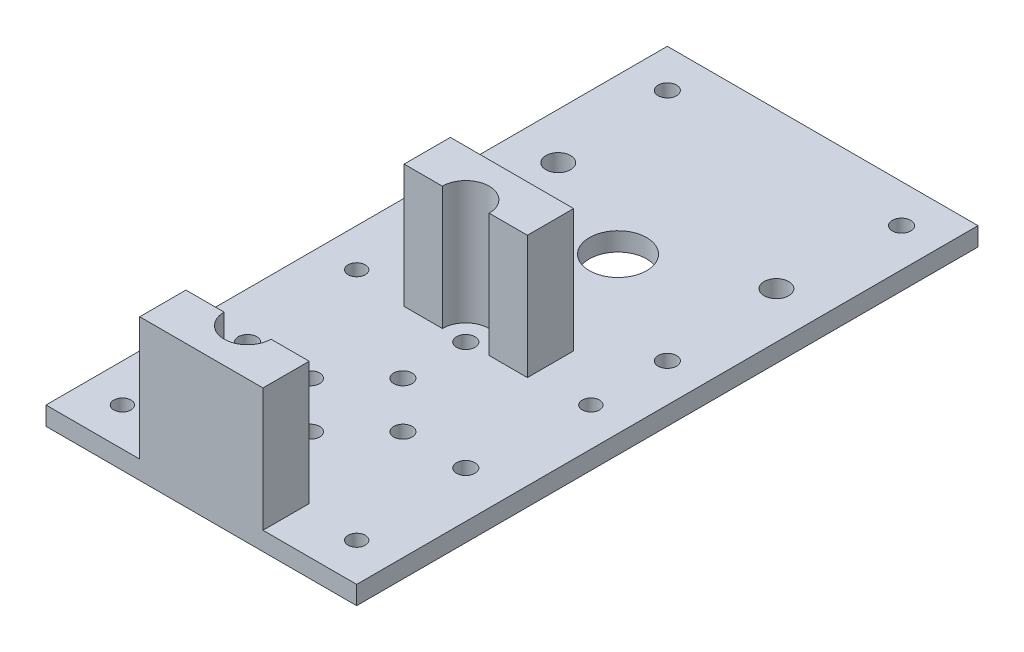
ISO-10303-21;
HEADER;
FILE_DESCRIPTION(('STEP AP214'),'2;1');
FILE_NAME('part.step','',(''),(''),'','','');
FILE_SCHEMA(('AUTOMOTIVE_DESIGN { 1 0 10303 214 1 1 1 1 }'));
ENDSEC;
DATA;
#1=APPLICATION_CONTEXT('core data for automotive mechanical design processes');
#2=APPLICATION_PROTOCOL_DEFINITION('international standard','automotive_design',2000,#1);
#3=PRODUCT_CONTEXT('',#1,'mechanical');
#4=PRODUCT('Part','Part','',(#3));
#5=PRODUCT_RELATED_PRODUCT_CATEGORY('part','',(#4));
#6=PRODUCT_DEFINITION_FORMATION('','',#4);
#7=PRODUCT_DEFINITION_CONTEXT('part definition',#1,'design');
#8=PRODUCT_DEFINITION('design','',#6,#7);
#9=PRODUCT_DEFINITION_SHAPE('','',#8);
#10=(LENGTH_UNIT() NAMED_UNIT(*) SI_UNIT(.MILLI.,.METRE.));
#11=(NAMED_UNIT(*) PLANE_ANGLE_UNIT() SI_UNIT($,.RADIAN.));
#12=(NAMED_UNIT(*) SI_UNIT($,.STERADIAN.) SOLID_ANGLE_UNIT());
#13=UNCERTAINTY_MEASURE_WITH_UNIT(LENGTH_MEASURE(1.E-05),#10,'distance_accuracy_value','');
#14=(GEOMETRIC_REPRESENTATION_CONTEXT(3) GLOBAL_UNCERTAINTY_ASSIGNED_CONTEXT((#13)) GLOBAL_UNIT_ASSIGNED_CONTEXT((#10,
#11,#12)) REPRESENTATION_CONTEXT('',''));
#15=CARTESIAN_POINT('',(0.,0.,0.));
#16=DIRECTION('',(0.,0.,1.));
#17=DIRECTION('',(1.,0.,0.));
#18=AXIS2_PLACEMENT_3D('',#15,#16,#17);
#19=CARTESIAN_POINT('',(-25.2,-3.,-75.6));
#20=DIRECTION('',(-1.,0.,0.));
#21=DIRECTION('',(0.,0.,1.));
#22=AXIS2_PLACEMENT_3D('',#19,#20,#21);
#23=PLANE('',#22);
#24=DIRECTION('',(0.,0.,1.));
#25=VECTOR('',#24,1.);
#26=CARTESIAN_POINT('',(-25.2,0.,-75.6));
#27=LINE('',#26,#25);
#28=CARTESIAN_POINT('',(-25.2,0.,-75.6));
#29=VERTEX_POINT('',#28);
#30=CARTESIAN_POINT('',(-25.2,0.,25.2));
#31=VERTEX_POINT('',#30);
#32=EDGE_CURVE('E409',#29,#31,#27,.T.);
#33=ORIENTED_EDGE('',*,*,#32,.F.);
#34=DIRECTION('',(0.,1.,0.));
#35=VECTOR('',#34,1.);
#36=CARTESIAN_POINT('',(-25.2,-3.,-75.6));
#37=LINE('',#36,#35);
#38=CARTESIAN_POINT('',(-25.2,-3.,-75.6));
#39=VERTEX_POINT('',#38);
#40=EDGE_CURVE('E11',#39,#29,#37,.T.);
#41=ORIENTED_EDGE('',*,*,#40,.F.);
#42=DIRECTION('',(0.,0.,1.));
#43=VECTOR('',#42,1.);
#44=CARTESIAN_POINT('',(-25.2,-3.,-75.6));
#45=LINE('',#44,#43);
#46=CARTESIAN_POINT('',(-25.2,-3.,25.2));
#47=VERTEX_POINT('',#46);
#48=EDGE_CURVE('E412',#39,#47,#45,.T.);
#49=ORIENTED_EDGE('',*,*,#48,.T.);
#50=DIRECTION('',(0.,1.,0.));
#51=VECTOR('',#50,1.);
#52=CARTESIAN_POINT('',(-25.2,-3.,25.2));
#53=LINE('',#52,#51);
#54=EDGE_CURVE('E311',#47,#31,#53,.T.);
#55=ORIENTED_EDGE('',*,*,#54,.T.);
#56=EDGE_LOOP('',(#33,#41,#49,#55));
#57=FACE_BOUND('',#56,.T.);
#58=ADVANCED_FACE('F45',(#57),#23,.T.);
#59=CARTESIAN_POINT('',(25.2,-3.,-75.6));
#60=DIRECTION('',(0.,0.,-1.));
#61=DIRECTION('',(-1.,0.,0.));
#62=AXIS2_PLACEMENT_3D('',#59,#60,#61);
#63=PLANE('',#62);
#64=DIRECTION('',(-1.,0.,0.));
#65=VECTOR('',#64,1.);
#66=CARTESIAN_POINT('',(25.2,0.,-75.6));
#67=LINE('',#66,#65);
#68=CARTESIAN_POINT('',(25.2,0.,-75.6));
#69=VERTEX_POINT('',#68);
#70=EDGE_CURVE('E423',#69,#29,#67,.T.);
#71=ORIENTED_EDGE('',*,*,#70,.F.);
#72=DIRECTION('',(0.,1.,0.));
#73=VECTOR('',#72,1.);
#74=CARTESIAN_POINT('',(25.2,-3.,-75.6));
#75=LINE('',#74,#73);
#76=CARTESIAN_POINT('',(25.2,-3.,-75.6));
#77=VERTEX_POINT('',#76);
#78=EDGE_CURVE('E56',#77,#69,#75,.T.);
#79=ORIENTED_EDGE('',*,*,#78,.F.);
#80=DIRECTION('',(-1.,0.,0.));
#81=VECTOR('',#80,1.);
#82=CARTESIAN_POINT('',(25.2,-3.,-75.6));
#83=LINE('',#82,#81);
#84=EDGE_CURVE('E408',#77,#39,#83,.T.);
#85=ORIENTED_EDGE('',*,*,#84,.T.);
#86=ORIENTED_EDGE('',*,*,#40,.T.);
#87=EDGE_LOOP('',(#71,#79,#85,#86));
#88=FACE_BOUND('',#87,.T.);
#89=ADVANCED_FACE('F495',(#88),#63,.T.);
#90=CARTESIAN_POINT('',(25.2,-3.,-75.6));
#91=DIRECTION('',(1.,0.,0.));
#92=DIRECTION('',(0.,0.,-1.));
#93=AXIS2_PLACEMENT_3D('',#90,#91,#92);
#94=PLANE('',#93);
#95=DIRECTION('',(0.,0.,-1.));
#96=VECTOR('',#95,1.);
#97=CARTESIAN_POINT('',(25.2,0.,-75.6));
#98=LINE('',#97,#96);
#99=CARTESIAN_POINT('',(25.2,0.,25.2));
#100=VERTEX_POINT('',#99);
#101=EDGE_CURVE('E419',#100,#69,#98,.T.);
#102=ORIENTED_EDGE('',*,*,#101,.F.);
#103=DIRECTION('',(0.,1.,0.));
#104=VECTOR('',#103,1.);
#105=CARTESIAN_POINT('',(25.2,-3.,25.2));
#106=LINE('',#105,#104);
#107=CARTESIAN_POINT('',(25.2,-3.,25.2));
#108=VERTEX_POINT('',#107);
#109=EDGE_CURVE('E317',#108,#100,#106,.T.);
#110=ORIENTED_EDGE('',*,*,#109,.F.);
#111=DIRECTION('',(0.,0.,-1.));
#112=VECTOR('',#111,1.);
#113=CARTESIAN_POINT('',(25.2,-3.,-75.6));
#114=LINE('',#113,#112);
#115=EDGE_CURVE('E405',#108,#77,#114,.T.);
#116=ORIENTED_EDGE('',*,*,#115,.T.);
#117=ORIENTED_EDGE('',*,*,#78,.T.);
#118=EDGE_LOOP('',(#102,#110,#116,#117));
#119=FACE_BOUND('',#118,.T.);
#120=ADVANCED_FACE('F47',(#119),#94,.T.);
#121=CARTESIAN_POINT('',(0.,-3.,-50.4));
#122=DIRECTION('',(0.,1.,0.));
#123=DIRECTION('',(-1.,0.,0.));
#124=AXIS2_PLACEMENT_3D('',#121,#122,#123);
#125=PLANE('',#124);
#126=CARTESIAN_POINT('',(-19.,-3.,-69.3999999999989));
#127=DIRECTION('',(0.,1.,0.));
#128=DIRECTION('',(-1.,0.,0.));
#129=AXIS2_PLACEMENT_3D('',#126,#127,#128);
#130=CIRCLE('',#129,1.50000000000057);
#131=CARTESIAN_POINT('',(-20.5000000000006,-3.,-69.3999999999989));
#132=VERTEX_POINT('',#131);
#133=EDGE_CURVE('E379',#132,#132,#130,.F.);
#134=ORIENTED_EDGE('',*,*,#133,.F.);
#135=EDGE_LOOP('',(#134));
#136=FACE_BOUND('',#135,.T.);
#137=CARTESIAN_POINT('',(-18.9999999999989,-3.,-31.3999999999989));
#138=DIRECTION('',(0.,1.,0.));
#139=DIRECTION('',(-1.,0.,0.));
#140=AXIS2_PLACEMENT_3D('',#137,#138,#139);
#141=CIRCLE('',#140,1.50000000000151);
#142=CARTESIAN_POINT('',(-20.5000000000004,-3.,-31.3999999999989));
#143=VERTEX_POINT('',#142);
#144=EDGE_CURVE('E371',#143,#143,#141,.F.);
#145=ORIENTED_EDGE('',*,*,#144,.F.);
#146=EDGE_LOOP('',(#145));
#147=FACE_BOUND('',#146,.T.);
#148=CARTESIAN_POINT('',(19.0000000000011,-3.,-31.4));
#149=DIRECTION('',(0.,1.,0.));
#150=DIRECTION('',(-1.,0.,0.));
#151=AXIS2_PLACEMENT_3D('',#148,#149,#150);
#152=CIRCLE('',#151,1.50000000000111);
#153=CARTESIAN_POINT('',(17.5,-3.,-31.4));
#154=VERTEX_POINT('',#153);
#155=EDGE_CURVE('E362',#154,#154,#152,.F.);
#156=ORIENTED_EDGE('',*,*,#155,.F.);
#157=EDGE_LOOP('',(#156));
#158=FACE_BOUND('',#157,.T.);
#159=CARTESIAN_POINT('',(0.,-3.,-42.4));
#160=DIRECTION('',(0.,1.,0.));
#161=DIRECTION('',(-1.,0.,0.));
#162=AXIS2_PLACEMENT_3D('',#159,#160,#161);
#163=CIRCLE('',#162,4.65);
#164=CARTESIAN_POINT('',(-4.65,-3.,-42.4));
#165=VERTEX_POINT('',#164);
#166=EDGE_CURVE('E361',#165,#165,#163,.F.);
#167=ORIENTED_EDGE('',*,*,#166,.F.);
#168=EDGE_LOOP('',(#167));
#169=FACE_BOUND('',#168,.T.);
#170=CARTESIAN_POINT('',(19.,-3.,-69.4));
#171=DIRECTION('',(0.,1.,0.));
#172=DIRECTION('',(-1.,0.,0.));
#173=AXIS2_PLACEMENT_3D('',#170,#171,#172);
#174=CIRCLE('',#173,1.5);
#175=CARTESIAN_POINT('',(17.5,-3.,-69.4));
#176=VERTEX_POINT('',#175);
#177=EDGE_CURVE('E392',#176,#176,#174,.F.);
#178=ORIENTED_EDGE('',*,*,#177,.F.);
#179=EDGE_LOOP('',(#178));
#180=FACE_BOUND('',#179,.T.);
#181=CARTESIAN_POINT('',(17.7,-3.,-50.4));
#182=DIRECTION('',(0.,1.,0.));
#183=DIRECTION('',(-1.,0.,0.));
#184=AXIS2_PLACEMENT_3D('',#181,#182,#183);
#185=CIRCLE('',#184,2.);
#186=CARTESIAN_POINT('',(15.7,-3.,-50.4));
#187=VERTEX_POINT('',#186);
#188=EDGE_CURVE('E397',#187,#187,#185,.T.);
#189=ORIENTED_EDGE('',*,*,#188,.T.);
#190=EDGE_LOOP('',(#189));
#191=FACE_BOUND('',#190,.T.);
#192=CARTESIAN_POINT('',(-17.7,-3.,-50.4));
#193=DIRECTION('',(0.,1.,0.));
#194=DIRECTION('',(1.,0.,0.));
#195=AXIS2_PLACEMENT_3D('',#192,#193,#194);
#196=CIRCLE('',#195,2.);
#197=CARTESIAN_POINT('',(-15.7,-3.,-50.4));
#198=VERTEX_POINT('',#197);
#199=EDGE_CURVE('E396',#198,#198,#196,.T.);
#200=ORIENTED_EDGE('',*,*,#199,.T.);
#201=EDGE_LOOP('',(#200));
#202=FACE_BOUND('',#201,.T.);
#203=ORIENTED_EDGE('',*,*,#115,.F.);
#204=DIRECTION('',(1.,0.,0.));
#205=VECTOR('',#204,1.);
#206=CARTESIAN_POINT('',(-25.2,-3.,25.2));
#207=LINE('',#206,#205);
#208=EDGE_CURVE('E307',#47,#108,#207,.T.);
#209=ORIENTED_EDGE('',*,*,#208,.F.);
#210=ORIENTED_EDGE('',*,*,#48,.F.);
#211=ORIENTED_EDGE('',*,*,#84,.F.);
#212=EDGE_LOOP('',(#203,#209,#210,#211));
#213=FACE_BOUND('',#212,.T.);
#214=CARTESIAN_POINT('',(0.,-3.,-7.5));
#215=DIRECTION('',(0.,1.,0.));
#216=DIRECTION('',(0.,0.,1.));
#217=AXIS2_PLACEMENT_3D('',#214,#215,#216);
#218=CIRCLE('',#217,1.5);
#219=CARTESIAN_POINT('',(0.,-3.,-6.));
#220=VERTEX_POINT('',#219);
#221=EDGE_CURVE('E353',#220,#220,#218,.T.);
#222=ORIENTED_EDGE('',*,*,#221,.T.);
#223=EDGE_LOOP('',(#222));
#224=FACE_BOUND('',#223,.T.);
#225=CARTESIAN_POINT('',(7.5,-3.,0.));
#226=DIRECTION('',(0.,1.,0.));
#227=DIRECTION('',(0.,0.,1.));
#228=AXIS2_PLACEMENT_3D('',#225,#226,#227);
#229=CIRCLE('',#228,1.5);
#230=CARTESIAN_POINT('',(7.5,-3.,1.50000000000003));
#231=VERTEX_POINT('',#230);
#232=EDGE_CURVE('E349',#231,#231,#229,.T.);
#233=ORIENTED_EDGE('',*,*,#232,.T.);
#234=EDGE_LOOP('',(#233));
#235=FACE_BOUND('',#234,.T.);
#236=CARTESIAN_POINT('',(0.,-3.,7.5));
#237=DIRECTION('',(0.,1.,0.));
#238=DIRECTION('',(0.,0.,1.));
#239=AXIS2_PLACEMENT_3D('',#236,#237,#238);
#240=CIRCLE('',#239,1.5);
#241=CARTESIAN_POINT('',(0.,-3.,9.));
#242=VERTEX_POINT('',#241);
#243=EDGE_CURVE('E344',#242,#242,#240,.T.);
#244=ORIENTED_EDGE('',*,*,#243,.T.);
#245=EDGE_LOOP('',(#244));
#246=FACE_BOUND('',#245,.T.);
#247=CARTESIAN_POINT('',(-7.5,-3.,0.));
#248=DIRECTION('',(0.,1.,0.));
#249=DIRECTION('',(0.,0.,1.));
#250=AXIS2_PLACEMENT_3D('',#247,#248,#249);
#251=CIRCLE('',#250,1.5);
#252=CARTESIAN_POINT('',(-7.5,-3.,1.49999999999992));
#253=VERTEX_POINT('',#252);
#254=EDGE_CURVE('E340',#253,#253,#251,.T.);
#255=ORIENTED_EDGE('',*,*,#254,.T.);
#256=EDGE_LOOP('',(#255));
#257=FACE_BOUND('',#256,.T.);
#258=CARTESIAN_POINT('',(-18.9999999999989,-3.,19.));
#259=DIRECTION('',(0.,1.,0.));
#260=DIRECTION('',(0.,0.,1.));
#261=AXIS2_PLACEMENT_3D('',#258,#259,#260);
#262=CIRCLE('',#261,1.4);
#263=CARTESIAN_POINT('',(-18.9999999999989,-3.,20.4));
#264=VERTEX_POINT('',#263);
#265=EDGE_CURVE('E276',#264,#264,#262,.T.);
#266=ORIENTED_EDGE('',*,*,#265,.T.);
#267=EDGE_LOOP('',(#266));
#268=FACE_BOUND('',#267,.T.);
#269=CARTESIAN_POINT('',(19.0000000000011,-3.,18.9999999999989));
#270=DIRECTION('',(0.,1.,0.));
#271=DIRECTION('',(0.,0.,1.));
#272=AXIS2_PLACEMENT_3D('',#269,#270,#271);
#273=CIRCLE('',#272,1.4);
#274=CARTESIAN_POINT('',(19.0000000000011,-3.,20.3999999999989));
#275=VERTEX_POINT('',#274);
#276=EDGE_CURVE('E268',#275,#275,#273,.T.);
#277=ORIENTED_EDGE('',*,*,#276,.T.);
#278=EDGE_LOOP('',(#277));
#279=FACE_BOUND('',#278,.T.);
#280=CARTESIAN_POINT('',(19.,-3.,-19.0000000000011));
#281=DIRECTION('',(0.,1.,0.));
#282=DIRECTION('',(0.,0.,1.));
#283=AXIS2_PLACEMENT_3D('',#280,#281,#282);
#284=CIRCLE('',#283,1.4);
#285=CARTESIAN_POINT('',(19.,-3.,-17.6000000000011));
#286=VERTEX_POINT('',#285);
#287=EDGE_CURVE('E259',#286,#286,#284,.T.);
#288=ORIENTED_EDGE('',*,*,#287,.T.);
#289=EDGE_LOOP('',(#288));
#290=FACE_BOUND('',#289,.T.);
#291=CARTESIAN_POINT('',(-19.,-3.,-19.));
#292=DIRECTION('',(0.,1.,0.));
#293=DIRECTION('',(0.,0.,1.));
#294=AXIS2_PLACEMENT_3D('',#291,#292,#293);
#295=CIRCLE('',#294,1.4);
#296=CARTESIAN_POINT('',(-19.,-3.,-17.6));
#297=VERTEX_POINT('',#296);
#298=EDGE_CURVE('E283',#297,#297,#295,.T.);
#299=ORIENTED_EDGE('',*,*,#298,.T.);
#300=EDGE_LOOP('',(#299));
#301=FACE_BOUND('',#300,.T.);
#302=CARTESIAN_POINT('',(0.,-3.,-17.7));
#303=DIRECTION('',(0.,1.,0.));
#304=DIRECTION('',(0.,0.,1.));
#305=AXIS2_PLACEMENT_3D('',#302,#303,#304);
#306=CIRCLE('',#305,1.5);
#307=CARTESIAN_POINT('',(0.,-3.,-16.2));
#308=VERTEX_POINT('',#307);
#309=EDGE_CURVE('E291',#308,#308,#306,.T.);
#310=ORIENTED_EDGE('',*,*,#309,.T.);
#311=EDGE_LOOP('',(#310));
#312=FACE_BOUND('',#311,.T.);
#313=CARTESIAN_POINT('',(17.7,-3.,0.));
#314=DIRECTION('',(0.,1.,0.));
#315=DIRECTION('',(0.,0.,1.));
#316=AXIS2_PLACEMENT_3D('',#313,#314,#315);
#317=CIRCLE('',#316,1.5);
#318=CARTESIAN_POINT('',(17.7,-3.,1.50000000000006));
#319=VERTEX_POINT('',#318);
#320=EDGE_CURVE('E296',#319,#319,#317,.T.);
#321=ORIENTED_EDGE('',*,*,#320,.T.);
#322=EDGE_LOOP('',(#321));
#323=FACE_BOUND('',#322,.T.);
#324=CARTESIAN_POINT('',(1.00290147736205E-12,-3.,17.7));
#325=DIRECTION('',(0.,1.,0.));
#326=DIRECTION('',(0.,0.,1.));
#327=AXIS2_PLACEMENT_3D('',#324,#325,#326);
#328=CIRCLE('',#327,1.50000000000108);
#329=CARTESIAN_POINT('',(1.00290147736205E-12,-3.,19.2000000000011));
#330=VERTEX_POINT('',#329);
#331=EDGE_CURVE('E300',#330,#330,#328,.T.);
#332=ORIENTED_EDGE('',*,*,#331,.T.);
#333=EDGE_LOOP('',(#332));
#334=FACE_BOUND('',#333,.T.);
#335=CARTESIAN_POINT('',(-17.6999999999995,-3.,5.03064256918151E-13));
#336=DIRECTION('',(0.,1.,0.));
#337=DIRECTION('',(0.,0.,1.));
#338=AXIS2_PLACEMENT_3D('',#335,#336,#337);
#339=CIRCLE('',#338,1.50000000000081);
#340=CARTESIAN_POINT('',(-17.6999999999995,-3.,1.50000000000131));
#341=VERTEX_POINT('',#340);
#342=EDGE_CURVE('E287',#341,#341,#339,.T.);
#343=ORIENTED_EDGE('',*,*,#342,.T.);
#344=EDGE_LOOP('',(#343));
#345=FACE_BOUND('',#344,.T.);
#346=ADVANCED_FACE('F445',(#136,#147,#158,#169,#180,#191,#202,#213,#224,#235,#246,#257,#268,
#279,#290,#301,#312,#323,#334,#345),#125,.F.);
#347=CARTESIAN_POINT('',(0.,0.,-50.4));
#348=DIRECTION('',(0.,1.,0.));
#349=DIRECTION('',(-1.,0.,0.));
#350=AXIS2_PLACEMENT_3D('',#347,#348,#349);
#351=PLANE('',#350);
#352=ORIENTED_EDGE('',*,*,#32,.T.);
#353=DIRECTION('',(1.,0.,0.));
#354=VECTOR('',#353,1.);
#355=CARTESIAN_POINT('',(-25.2,0.,25.2));
#356=LINE('',#355,#354);
#357=CARTESIAN_POINT('',(-10.,0.,25.2));
#358=VERTEX_POINT('',#357);
#359=EDGE_CURVE('E312',#31,#358,#356,.T.);
#360=ORIENTED_EDGE('',*,*,#359,.T.);
#361=DIRECTION('',(0.,0.,1.));
#362=VECTOR('',#361,1.);
#363=CARTESIAN_POINT('',(-10.,0.,17.7));
#364=LINE('',#363,#362);
#365=CARTESIAN_POINT('',(-10.,0.,17.7));
#366=VERTEX_POINT('',#365);
#367=EDGE_CURVE('E536',#366,#358,#364,.T.);
#368=ORIENTED_EDGE('',*,*,#367,.F.);
#369=DIRECTION('',(-1.,0.,0.));
#370=VECTOR('',#369,1.);
#371=CARTESIAN_POINT('',(-3.8,0.,17.7));
#372=LINE('',#371,#370);
#373=CARTESIAN_POINT('',(-3.8,0.,17.7));
#374=VERTEX_POINT('',#373);
#375=EDGE_CURVE('E539',#374,#366,#372,.T.);
#376=ORIENTED_EDGE('',*,*,#375,.F.);
#377=CARTESIAN_POINT('',(0.,0.,17.7));
#378=DIRECTION('',(0.,-1.,0.));
#379=DIRECTION('',(0.,0.,-1.));
#380=AXIS2_PLACEMENT_3D('',#377,#378,#379);
#381=CIRCLE('',#380,3.8);
#382=CARTESIAN_POINT('',(3.8,0.,17.7));
#383=VERTEX_POINT('',#382);
#384=EDGE_CURVE('E187',#383,#374,#381,.T.);
#385=ORIENTED_EDGE('',*,*,#384,.F.);
#386=DIRECTION('',(-1.,0.,0.));
#387=VECTOR('',#386,1.);
#388=CARTESIAN_POINT('',(10.,0.,17.7));
#389=LINE('',#388,#387);
#390=CARTESIAN_POINT('',(10.,0.,17.7));
#391=VERTEX_POINT('',#390);
#392=EDGE_CURVE('E183',#391,#383,#389,.T.);
#393=ORIENTED_EDGE('',*,*,#392,.F.);
#394=DIRECTION('',(0.,0.,-1.));
#395=VECTOR('',#394,1.);
#396=CARTESIAN_POINT('',(10.,0.,17.7));
#397=LINE('',#396,#395);
#398=CARTESIAN_POINT('',(10.,0.,25.2));
#399=VERTEX_POINT('',#398);
#400=EDGE_CURVE('E533',#399,#391,#397,.T.);
#401=ORIENTED_EDGE('',*,*,#400,.F.);
#402=EDGE_CURVE('E316',#399,#100,#356,.T.);
#403=ORIENTED_EDGE('',*,*,#402,.T.);
#404=ORIENTED_EDGE('',*,*,#101,.T.);
#405=ORIENTED_EDGE('',*,*,#70,.T.);
#406=EDGE_LOOP('',(#352,#360,#368,#376,#385,#393,#401,#403,#404,#405));
#407=FACE_BOUND('',#406,.T.);
#408=CARTESIAN_POINT('',(-19.,0.,-69.3999999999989));
#409=DIRECTION('',(0.,1.,0.));
#410=DIRECTION('',(-1.,0.,0.));
#411=AXIS2_PLACEMENT_3D('',#408,#409,#410);
#412=CIRCLE('',#411,1.50000000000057);
#413=CARTESIAN_POINT('',(-20.5000000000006,0.,-69.3999999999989));
#414=VERTEX_POINT('',#413);
#415=EDGE_CURVE('E321',#414,#414,#412,.T.);
#416=ORIENTED_EDGE('',*,*,#415,.F.);
#417=EDGE_LOOP('',(#416));
#418=FACE_BOUND('',#417,.T.);
#419=CARTESIAN_POINT('',(-18.9999999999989,0.,-31.3999999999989));
#420=DIRECTION('',(0.,1.,0.));
#421=DIRECTION('',(-1.,0.,0.));
#422=AXIS2_PLACEMENT_3D('',#419,#420,#421);
#423=CIRCLE('',#422,1.50000000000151);
#424=CARTESIAN_POINT('',(-20.5000000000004,0.,-31.3999999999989));
#425=VERTEX_POINT('',#424);
#426=EDGE_CURVE('E375',#425,#425,#423,.T.);
#427=ORIENTED_EDGE('',*,*,#426,.F.);
#428=EDGE_LOOP('',(#427));
#429=FACE_BOUND('',#428,.T.);
#430=CARTESIAN_POINT('',(19.0000000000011,0.,-31.4));
#431=DIRECTION('',(0.,1.,0.));
#432=DIRECTION('',(-1.,0.,0.));
#433=AXIS2_PLACEMENT_3D('',#430,#431,#432);
#434=CIRCLE('',#433,1.50000000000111);
#435=CARTESIAN_POINT('',(17.5,0.,-31.4));
#436=VERTEX_POINT('',#435);
#437=EDGE_CURVE('E367',#436,#436,#434,.T.);
#438=ORIENTED_EDGE('',*,*,#437,.F.);
#439=EDGE_LOOP('',(#438));
#440=FACE_BOUND('',#439,.T.);
#441=CARTESIAN_POINT('',(0.,0.,-42.4));
#442=DIRECTION('',(0.,1.,0.));
#443=DIRECTION('',(-1.,0.,0.));
#444=AXIS2_PLACEMENT_3D('',#441,#442,#443);
#445=CIRCLE('',#444,4.65);
#446=CARTESIAN_POINT('',(-4.65,0.,-42.4));
#447=VERTEX_POINT('',#446);
#448=EDGE_CURVE('E357',#447,#447,#445,.T.);
#449=ORIENTED_EDGE('',*,*,#448,.F.);
#450=EDGE_LOOP('',(#449));
#451=FACE_BOUND('',#450,.T.);
#452=CARTESIAN_POINT('',(19.,0.,-69.4));
#453=DIRECTION('',(0.,1.,0.));
#454=DIRECTION('',(-1.,0.,0.));
#455=AXIS2_PLACEMENT_3D('',#452,#453,#454);
#456=CIRCLE('',#455,1.5);
#457=CARTESIAN_POINT('',(17.5,0.,-69.4));
#458=VERTEX_POINT('',#457);
#459=EDGE_CURVE('E366',#458,#458,#456,.T.);
#460=ORIENTED_EDGE('',*,*,#459,.F.);
#461=EDGE_LOOP('',(#460));
#462=FACE_BOUND('',#461,.T.);
#463=CARTESIAN_POINT('',(17.7,0.,-50.4));
#464=DIRECTION('',(0.,1.,0.));
#465=DIRECTION('',(-1.,0.,0.));
#466=AXIS2_PLACEMENT_3D('',#463,#464,#465);
#467=CIRCLE('',#466,2.);
#468=CARTESIAN_POINT('',(15.7,0.,-50.4));
#469=VERTEX_POINT('',#468);
#470=EDGE_CURVE('E49',#469,#469,#467,.T.);
#471=ORIENTED_EDGE('',*,*,#470,.F.);
#472=EDGE_LOOP('',(#471));
#473=FACE_BOUND('',#472,.T.);
#474=CARTESIAN_POINT('',(-17.7,0.,-50.4));
#475=DIRECTION('',(0.,1.,0.));
#476=DIRECTION('',(-1.,0.,0.));
#477=AXIS2_PLACEMENT_3D('',#474,#475,#476);
#478=CIRCLE('',#477,2.);
#479=CARTESIAN_POINT('',(-19.7,0.,-50.4));
#480=VERTEX_POINT('',#479);
#481=EDGE_CURVE('E401',#480,#480,#478,.T.);
#482=ORIENTED_EDGE('',*,*,#481,.F.);
#483=EDGE_LOOP('',(#482));
#484=FACE_BOUND('',#483,.T.);
#485=DIRECTION('',(0.,0.,1.));
#486=VECTOR('',#485,1.);
#487=CARTESIAN_POINT('',(-10.,0.,-17.7));
#488=LINE('',#487,#486);
#489=CARTESIAN_POINT('',(-10.,0.,-25.2));
#490=VERTEX_POINT('',#489);
#491=CARTESIAN_POINT('',(-10.,0.,-17.7));
#492=VERTEX_POINT('',#491);
#493=EDGE_CURVE('E228',#490,#492,#488,.T.);
#494=ORIENTED_EDGE('',*,*,#493,.F.);
#495=DIRECTION('',(1.,0.,0.));
#496=VECTOR('',#495,1.);
#497=CARTESIAN_POINT('',(25.2,0.,-25.2));
#498=LINE('',#497,#496);
#499=CARTESIAN_POINT('',(10.,0.,-25.2));
#500=VERTEX_POINT('',#499);
#501=EDGE_CURVE('E415',#490,#500,#498,.T.);
#502=ORIENTED_EDGE('',*,*,#501,.T.);
#503=DIRECTION('',(0.,0.,-1.));
#504=VECTOR('',#503,1.);
#505=CARTESIAN_POINT('',(10.,0.,-17.7));
#506=LINE('',#505,#504);
#507=CARTESIAN_POINT('',(10.,0.,-17.7));
#508=VERTEX_POINT('',#507);
#509=EDGE_CURVE('E225',#508,#500,#506,.T.);
#510=ORIENTED_EDGE('',*,*,#509,.F.);
#511=DIRECTION('',(1.,0.,0.));
#512=VECTOR('',#511,1.);
#513=CARTESIAN_POINT('',(10.,0.,-17.7));
#514=LINE('',#513,#512);
#515=CARTESIAN_POINT('',(3.8,0.,-17.7));
#516=VERTEX_POINT('',#515);
#517=EDGE_CURVE('E195',#516,#508,#514,.T.);
#518=ORIENTED_EDGE('',*,*,#517,.F.);
#519=CARTESIAN_POINT('',(0.,0.,-17.7));
#520=DIRECTION('',(0.,-1.,0.));
#521=DIRECTION('',(0.,0.,1.));
#522=AXIS2_PLACEMENT_3D('',#519,#520,#521);
#523=CIRCLE('',#522,3.8);
#524=CARTESIAN_POINT('',(-3.8,0.,-17.7));
#525=VERTEX_POINT('',#524);
#526=EDGE_CURVE('E190',#525,#516,#523,.T.);
#527=ORIENTED_EDGE('',*,*,#526,.F.);
#528=DIRECTION('',(1.,0.,0.));
#529=VECTOR('',#528,1.);
#530=CARTESIAN_POINT('',(-3.8,0.,-17.7));
#531=LINE('',#530,#529);
#532=EDGE_CURVE('E206',#492,#525,#531,.T.);
#533=ORIENTED_EDGE('',*,*,#532,.F.);
#534=EDGE_LOOP('',(#494,#502,#510,#518,#527,#533));
#535=FACE_BOUND('',#534,.T.);
#536=CARTESIAN_POINT('',(0.,0.,-7.5));
#537=DIRECTION('',(0.,1.,0.));
#538=DIRECTION('',(0.,0.,1.));
#539=AXIS2_PLACEMENT_3D('',#536,#537,#538);
#540=CIRCLE('',#539,1.5);
#541=CARTESIAN_POINT('',(0.,0.,-6.));
#542=VERTEX_POINT('',#541);
#543=EDGE_CURVE('E345',#542,#542,#540,.T.);
#544=ORIENTED_EDGE('',*,*,#543,.F.);
#545=EDGE_LOOP('',(#544));
#546=FACE_BOUND('',#545,.T.);
#547=CARTESIAN_POINT('',(7.5,0.,0.));
#548=DIRECTION('',(0.,1.,0.));
#549=DIRECTION('',(0.,0.,1.));
#550=AXIS2_PLACEMENT_3D('',#547,#548,#549);
#551=CIRCLE('',#550,1.5);
#552=CARTESIAN_POINT('',(7.5,0.,1.50000000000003));
#553=VERTEX_POINT('',#552);
#554=EDGE_CURVE('E457',#553,#553,#551,.T.);
#555=ORIENTED_EDGE('',*,*,#554,.F.);
#556=EDGE_LOOP('',(#555));
#557=FACE_BOUND('',#556,.T.);
#558=CARTESIAN_POINT('',(0.,0.,7.5));
#559=DIRECTION('',(0.,1.,0.));
#560=DIRECTION('',(0.,0.,1.));
#561=AXIS2_PLACEMENT_3D('',#558,#559,#560);
#562=CIRCLE('',#561,1.5);
#563=CARTESIAN_POINT('',(0.,0.,9.));
#564=VERTEX_POINT('',#563);
#565=EDGE_CURVE('E461',#564,#564,#562,.T.);
#566=ORIENTED_EDGE('',*,*,#565,.F.);
#567=EDGE_LOOP('',(#566));
#568=FACE_BOUND('',#567,.T.);
#569=CARTESIAN_POINT('',(-7.5,0.,0.));
#570=DIRECTION('',(0.,1.,0.));
#571=DIRECTION('',(0.,0.,1.));
#572=AXIS2_PLACEMENT_3D('',#569,#570,#571);
#573=CIRCLE('',#572,1.5);
#574=CARTESIAN_POINT('',(-7.5,0.,1.49999999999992));
#575=VERTEX_POINT('',#574);
#576=EDGE_CURVE('E465',#575,#575,#573,.T.);
#577=ORIENTED_EDGE('',*,*,#576,.F.);
#578=EDGE_LOOP('',(#577));
#579=FACE_BOUND('',#578,.T.);
#580=CARTESIAN_POINT('',(-18.9999999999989,0.,19.));
#581=DIRECTION('',(0.,1.,0.));
#582=DIRECTION('',(0.,0.,1.));
#583=AXIS2_PLACEMENT_3D('',#580,#581,#582);
#584=CIRCLE('',#583,1.4);
#585=CARTESIAN_POINT('',(-18.9999999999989,0.,20.4));
#586=VERTEX_POINT('',#585);
#587=EDGE_CURVE('E258',#586,#586,#584,.T.);
#588=ORIENTED_EDGE('',*,*,#587,.F.);
#589=EDGE_LOOP('',(#588));
#590=FACE_BOUND('',#589,.T.);
#591=CARTESIAN_POINT('',(19.0000000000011,0.,18.9999999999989));
#592=DIRECTION('',(0.,1.,0.));
#593=DIRECTION('',(0.,0.,1.));
#594=AXIS2_PLACEMENT_3D('',#591,#592,#593);
#595=CIRCLE('',#594,1.4);
#596=CARTESIAN_POINT('',(19.0000000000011,0.,20.3999999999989));
#597=VERTEX_POINT('',#596);
#598=EDGE_CURVE('E272',#597,#597,#595,.T.);
#599=ORIENTED_EDGE('',*,*,#598,.F.);
#600=EDGE_LOOP('',(#599));
#601=FACE_BOUND('',#600,.T.);
#602=CARTESIAN_POINT('',(19.,0.,-19.0000000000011));
#603=DIRECTION('',(0.,1.,0.));
#604=DIRECTION('',(0.,0.,1.));
#605=AXIS2_PLACEMENT_3D('',#602,#603,#604);
#606=CIRCLE('',#605,1.4);
#607=CARTESIAN_POINT('',(19.,0.,-17.6000000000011));
#608=VERTEX_POINT('',#607);
#609=EDGE_CURVE('E264',#608,#608,#606,.T.);
#610=ORIENTED_EDGE('',*,*,#609,.F.);
#611=EDGE_LOOP('',(#610));
#612=FACE_BOUND('',#611,.T.);
#613=CARTESIAN_POINT('',(-19.,0.,-19.));
#614=DIRECTION('',(0.,1.,0.));
#615=DIRECTION('',(0.,0.,1.));
#616=AXIS2_PLACEMENT_3D('',#613,#614,#615);
#617=CIRCLE('',#616,1.4);
#618=CARTESIAN_POINT('',(-19.,0.,-17.6));
#619=VERTEX_POINT('',#618);
#620=EDGE_CURVE('E263',#619,#619,#617,.T.);
#621=ORIENTED_EDGE('',*,*,#620,.F.);
#622=EDGE_LOOP('',(#621));
#623=FACE_BOUND('',#622,.T.);
#624=CARTESIAN_POINT('',(0.,0.,-17.7));
#625=DIRECTION('',(0.,1.,0.));
#626=DIRECTION('',(0.,0.,1.));
#627=AXIS2_PLACEMENT_3D('',#624,#625,#626);
#628=CIRCLE('',#627,1.5);
#629=CARTESIAN_POINT('',(0.,0.,-16.2));
#630=VERTEX_POINT('',#629);
#631=EDGE_CURVE('E336',#630,#630,#628,.T.);
#632=ORIENTED_EDGE('',*,*,#631,.F.);
#633=EDGE_LOOP('',(#632));
#634=FACE_BOUND('',#633,.T.);
#635=CARTESIAN_POINT('',(17.7,0.,0.));
#636=DIRECTION('',(0.,1.,0.));
#637=DIRECTION('',(0.,0.,1.));
#638=AXIS2_PLACEMENT_3D('',#635,#636,#637);
#639=CIRCLE('',#638,1.5);
#640=CARTESIAN_POINT('',(17.7,0.,1.50000000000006));
#641=VERTEX_POINT('',#640);
#642=EDGE_CURVE('E332',#641,#641,#639,.T.);
#643=ORIENTED_EDGE('',*,*,#642,.F.);
#644=EDGE_LOOP('',(#643));
#645=FACE_BOUND('',#644,.T.);
#646=CARTESIAN_POINT('',(1.00290147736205E-12,0.,17.7));
#647=DIRECTION('',(0.,1.,0.));
#648=DIRECTION('',(0.,0.,1.));
#649=AXIS2_PLACEMENT_3D('',#646,#647,#648);
#650=CIRCLE('',#649,1.50000000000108);
#651=CARTESIAN_POINT('',(1.00290147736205E-12,0.,19.2000000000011));
#652=VERTEX_POINT('',#651);
#653=EDGE_CURVE('E328',#652,#652,#650,.T.);
#654=ORIENTED_EDGE('',*,*,#653,.F.);
#655=EDGE_LOOP('',(#654));
#656=FACE_BOUND('',#655,.T.);
#657=CARTESIAN_POINT('',(-17.6999999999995,0.,5.03064256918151E-13));
#658=DIRECTION('',(0.,1.,0.));
#659=DIRECTION('',(0.,0.,1.));
#660=AXIS2_PLACEMENT_3D('',#657,#658,#659);
#661=CIRCLE('',#660,1.50000000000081);
#662=CARTESIAN_POINT('',(-17.6999999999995,0.,1.50000000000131));
#663=VERTEX_POINT('',#662);
#664=EDGE_CURVE('E295',#663,#663,#661,.T.);
#665=ORIENTED_EDGE('',*,*,#664,.F.);
#666=EDGE_LOOP('',(#665));
#667=FACE_BOUND('',#666,.T.);
#668=ADVANCED_FACE('F441',(#407,#418,#429,#440,#451,#462,#473,#484,#535,#546,#557,#568,#579,
#590,#601,#612,#623,#634,#645,#656,#667),#351,.T.);
#669=CARTESIAN_POINT('',(-17.7,-3.,-50.4));
#670=DIRECTION('',(0.,1.,0.));
#671=DIRECTION('',(-1.,0.,0.));
#672=AXIS2_PLACEMENT_3D('',#669,#670,#671);
#673=CYLINDRICAL_SURFACE('',#672,2.);
#674=ORIENTED_EDGE('',*,*,#481,.T.);
#675=EDGE_LOOP('',(#674));
#676=FACE_BOUND('',#675,.T.);
#677=ORIENTED_EDGE('',*,*,#199,.F.);
#678=EDGE_LOOP('',(#677));
#679=FACE_BOUND('',#678,.T.);
#680=ADVANCED_FACE('F444',(#676,#679),#673,.F.);
#681=CARTESIAN_POINT('',(17.7,-3.,-50.4));
#682=DIRECTION('',(0.,1.,0.));
#683=DIRECTION('',(-1.,0.,0.));
#684=AXIS2_PLACEMENT_3D('',#681,#682,#683);
#685=CYLINDRICAL_SURFACE('',#684,2.);
#686=ORIENTED_EDGE('',*,*,#470,.T.);
#687=EDGE_LOOP('',(#686));
#688=FACE_BOUND('',#687,.T.);
#689=ORIENTED_EDGE('',*,*,#188,.F.);
#690=EDGE_LOOP('',(#689));
#691=FACE_BOUND('',#690,.T.);
#692=ADVANCED_FACE('F438',(#688,#691),#685,.F.);
#693=CARTESIAN_POINT('',(19.,-3.001,-69.4));
#694=DIRECTION('',(0.,1.,0.));
#695=DIRECTION('',(-1.,0.,0.));
#696=AXIS2_PLACEMENT_3D('',#693,#694,#695);
#697=CYLINDRICAL_SURFACE('',#696,1.5);
#698=CARTESIAN_POINT('',(17.5,0.,-69.4));
#699=CARTESIAN_POINT('',(17.5,-0.0312500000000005,-69.4));
#700=CARTESIAN_POINT('',(17.5,-0.0625000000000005,-69.4));
#701=CARTESIAN_POINT('',(17.5,-0.125000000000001,-69.4));
#702=CARTESIAN_POINT('',(17.5,-0.156250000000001,-69.4));
#703=CARTESIAN_POINT('',(17.5,-0.218750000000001,-69.4));
#704=CARTESIAN_POINT('',(17.5,-0.250000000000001,-69.4));
#705=CARTESIAN_POINT('',(17.5,-0.312500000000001,-69.4));
#706=CARTESIAN_POINT('',(17.5,-0.34375,-69.4));
#707=CARTESIAN_POINT('',(17.5,-0.40625,-69.4));
#708=CARTESIAN_POINT('',(17.5,-0.4375,-69.4));
#709=CARTESIAN_POINT('',(17.5,-0.5,-69.4));
#710=CARTESIAN_POINT('',(17.5,-0.53125,-69.4));
#711=CARTESIAN_POINT('',(17.5,-0.593750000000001,-69.4));
#712=CARTESIAN_POINT('',(17.5,-0.625000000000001,-69.4));
#713=CARTESIAN_POINT('',(17.5,-0.687500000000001,-69.4));
#714=CARTESIAN_POINT('',(17.5,-0.71875,-69.4));
#715=CARTESIAN_POINT('',(17.5,-0.78125,-69.4));
#716=CARTESIAN_POINT('',(17.5,-0.8125,-69.4));
#717=CARTESIAN_POINT('',(17.5,-0.875,-69.4));
#718=CARTESIAN_POINT('',(17.5,-0.90625,-69.4));
#719=CARTESIAN_POINT('',(17.5,-0.96875,-69.4));
#720=CARTESIAN_POINT('',(17.5,-1.,-69.4));
#721=CARTESIAN_POINT('',(17.5,-1.0625,-69.4));
#722=CARTESIAN_POINT('',(17.5,-1.09375,-69.4));
#723=CARTESIAN_POINT('',(17.5,-1.15625,-69.4));
#724=CARTESIAN_POINT('',(17.5,-1.1875,-69.4));
#725=CARTESIAN_POINT('',(17.5,-1.25,-69.4));
#726=CARTESIAN_POINT('',(17.5,-1.28125,-69.4));
#727=CARTESIAN_POINT('',(17.5,-1.34375,-69.4));
#728=CARTESIAN_POINT('',(17.5,-1.375,-69.4));
#729=CARTESIAN_POINT('',(17.5,-1.4375,-69.4));
#730=CARTESIAN_POINT('',(17.5,-1.46875,-69.4));
#731=CARTESIAN_POINT('',(17.5,-1.53125,-69.4));
#732=CARTESIAN_POINT('',(17.5,-1.5625,-69.4));
#733=CARTESIAN_POINT('',(17.5,-1.625,-69.4));
#734=CARTESIAN_POINT('',(17.5,-1.65625,-69.4));
#735=CARTESIAN_POINT('',(17.5,-1.71875,-69.4));
#736=CARTESIAN_POINT('',(17.5,-1.75,-69.4));
#737=CARTESIAN_POINT('',(17.5,-1.8125,-69.4));
#738=CARTESIAN_POINT('',(17.5,-1.84375,-69.4));
#739=CARTESIAN_POINT('',(17.5,-1.90625,-69.4));
#740=CARTESIAN_POINT('',(17.5,-1.9375,-69.4));
#741=CARTESIAN_POINT('',(17.5,-2.,-69.4));
#742=CARTESIAN_POINT('',(17.5,-2.03125,-69.4));
#743=CARTESIAN_POINT('',(17.5,-2.09375,-69.4));
#744=CARTESIAN_POINT('',(17.5,-2.125,-69.4));
#745=CARTESIAN_POINT('',(17.5,-2.1875,-69.4));
#746=CARTESIAN_POINT('',(17.5,-2.21875,-69.4));
#747=CARTESIAN_POINT('',(17.5,-2.28125,-69.4));
#748=CARTESIAN_POINT('',(17.5,-2.3125,-69.4));
#749=CARTESIAN_POINT('',(17.5,-2.375,-69.4));
#750=CARTESIAN_POINT('',(17.5,-2.40625,-69.4));
#751=CARTESIAN_POINT('',(17.5,-2.46875,-69.4));
#752=CARTESIAN_POINT('',(17.5,-2.5,-69.4));
#753=CARTESIAN_POINT('',(17.5,-2.5625,-69.4));
#754=CARTESIAN_POINT('',(17.5,-2.59375,-69.4));
#755=CARTESIAN_POINT('',(17.5,-2.65625,-69.4));
#756=CARTESIAN_POINT('',(17.5,-2.6875,-69.4));
#757=CARTESIAN_POINT('',(17.5,-2.75,-69.4));
#758=CARTESIAN_POINT('',(17.5,-2.78125,-69.4));
#759=CARTESIAN_POINT('',(17.5,-2.84375,-69.4));
#760=CARTESIAN_POINT('',(17.5,-2.875,-69.4));
#761=CARTESIAN_POINT('',(17.5,-2.9375,-69.4));
#762=CARTESIAN_POINT('',(17.5,-2.96875,-69.4));
#763=CARTESIAN_POINT('',(17.5,-3.,-69.4));
#764=B_SPLINE_CURVE_WITH_KNOTS('',3,(#698,#699,#700,#701,#702,#703,#704,#705,#706,#707,#708,
#709,#710,#711,#712,#713,#714,#715,#716,#717,#718,#719,#720,#721,#722,#723,#724,#725,#726,#727,
#728,#729,#730,#731,#732,#733,#734,#735,#736,#737,#738,#739,#740,#741,#742,#743,#744,#745,#746,
#747,#748,#749,#750,#751,#752,#753,#754,#755,#756,#757,#758,#759,#760,#761,#762,#763),
.UNSPECIFIED.,.F.,.F.,(4,2,2,2,2,2,2,2,2,2,2,2,2,2,2,2,2,2,2,2,2,2,2,2,2,2,2,2,2,2,2,2,4),(0.,
0.0937500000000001,0.1875,0.28125,0.375,0.46875,0.5625,0.65625,0.75,0.84375,0.9375,1.03125,
1.125,1.21875,1.3125,1.40625,1.5,1.59375,1.6875,1.78125,1.875,1.96875,2.0625,2.15625,2.25,
2.34375,2.4375,2.53125,2.625,2.71875,2.8125,2.90625,3.),.UNSPECIFIED.);
#765=EDGE_CURVE('BSEAM610',#458,#176,#764,.T.);
#766=ORIENTED_EDGE('',*,*,#459,.T.);
#767=ORIENTED_EDGE('',*,*,#177,.T.);
#768=ORIENTED_EDGE('',*,*,#765,.T.);
#769=ORIENTED_EDGE('',*,*,#765,.F.);
#770=EDGE_LOOP('',(#766,#768,#767,#769));
#771=FACE_BOUND('',#770,.T.);
#772=ADVANCED_FACE('F610',(#771),#697,.F.);
#773=CARTESIAN_POINT('',(0.,-3.001,-42.4));
#774=DIRECTION('',(0.,1.,0.));
#775=DIRECTION('',(-1.,0.,0.));
#776=AXIS2_PLACEMENT_3D('',#773,#774,#775);
#777=CYLINDRICAL_SURFACE('',#776,4.65);
#778=CARTESIAN_POINT('',(-4.65,0.,-42.4));
#779=CARTESIAN_POINT('',(-4.65,-0.0312500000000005,-42.4));
#780=CARTESIAN_POINT('',(-4.65,-0.0625000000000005,-42.4));
#781=CARTESIAN_POINT('',(-4.65,-0.125000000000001,-42.4));
#782=CARTESIAN_POINT('',(-4.65,-0.156250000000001,-42.4));
#783=CARTESIAN_POINT('',(-4.65,-0.218750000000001,-42.4));
#784=CARTESIAN_POINT('',(-4.65,-0.250000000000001,-42.4));
#785=CARTESIAN_POINT('',(-4.65,-0.312500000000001,-42.4));
#786=CARTESIAN_POINT('',(-4.65,-0.34375,-42.4));
#787=CARTESIAN_POINT('',(-4.65,-0.40625,-42.4));
#788=CARTESIAN_POINT('',(-4.65,-0.4375,-42.4));
#789=CARTESIAN_POINT('',(-4.65,-0.5,-42.4));
#790=CARTESIAN_POINT('',(-4.65,-0.53125,-42.4));
#791=CARTESIAN_POINT('',(-4.65,-0.593750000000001,-42.4));
#792=CARTESIAN_POINT('',(-4.65,-0.625000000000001,-42.4));
#793=CARTESIAN_POINT('',(-4.65,-0.687500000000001,-42.4));
#794=CARTESIAN_POINT('',(-4.65,-0.71875,-42.4));
#795=CARTESIAN_POINT('',(-4.65,-0.78125,-42.4));
#796=CARTESIAN_POINT('',(-4.65,-0.8125,-42.4));
#797=CARTESIAN_POINT('',(-4.65,-0.875,-42.4));
#798=CARTESIAN_POINT('',(-4.65,-0.90625,-42.4));
#799=CARTESIAN_POINT('',(-4.65,-0.96875,-42.4));
#800=CARTESIAN_POINT('',(-4.65,-1.,-42.4));
#801=CARTESIAN_POINT('',(-4.65,-1.0625,-42.4));
#802=CARTESIAN_POINT('',(-4.65,-1.09375,-42.4));
#803=CARTESIAN_POINT('',(-4.65,-1.15625,-42.4));
#804=CARTESIAN_POINT('',(-4.65,-1.1875,-42.4));
#805=CARTESIAN_POINT('',(-4.65,-1.25,-42.4));
#806=CARTESIAN_POINT('',(-4.65,-1.28125,-42.4));
#807=CARTESIAN_POINT('',(-4.65,-1.34375,-42.4));
#808=CARTESIAN_POINT('',(-4.65,-1.375,-42.4));
#809=CARTESIAN_POINT('',(-4.65,-1.4375,-42.4));
#810=CARTESIAN_POINT('',(-4.65,-1.46875,-42.4));
#811=CARTESIAN_POINT('',(-4.65,-1.53125,-42.4));
#812=CARTESIAN_POINT('',(-4.65,-1.5625,-42.4));
#813=CARTESIAN_POINT('',(-4.65,-1.625,-42.4));
#814=CARTESIAN_POINT('',(-4.65,-1.65625,-42.4));
#815=CARTESIAN_POINT('',(-4.65,-1.71875,-42.4));
#816=CARTESIAN_POINT('',(-4.65,-1.75,-42.4));
#817=CARTESIAN_POINT('',(-4.65,-1.8125,-42.4));
#818=CARTESIAN_POINT('',(-4.65,-1.84375,-42.4));
#819=CARTESIAN_POINT('',(-4.65,-1.90625,-42.4));
#820=CARTESIAN_POINT('',(-4.65,-1.9375,-42.4));
#821=CARTESIAN_POINT('',(-4.65,-2.,-42.4));
#822=CARTESIAN_POINT('',(-4.65,-2.03125,-42.4));
#823=CARTESIAN_POINT('',(-4.65,-2.09375,-42.4));
#824=CARTESIAN_POINT('',(-4.65,-2.125,-42.4));
#825=CARTESIAN_POINT('',(-4.65,-2.1875,-42.4));
#826=CARTESIAN_POINT('',(-4.65,-2.21875,-42.4));
#827=CARTESIAN_POINT('',(-4.65,-2.28125,-42.4));
#828=CARTESIAN_POINT('',(-4.65,-2.3125,-42.4));
#829=CARTESIAN_POINT('',(-4.65,-2.375,-42.4));
#830=CARTESIAN_POINT('',(-4.65,-2.40625,-42.4));
#831=CARTESIAN_POINT('',(-4.65,-2.46875,-42.4));
#832=CARTESIAN_POINT('',(-4.65,-2.5,-42.4));
#833=CARTESIAN_POINT('',(-4.65,-2.5625,-42.4));
#834=CARTESIAN_POINT('',(-4.65,-2.59375,-42.4));
#835=CARTESIAN_POINT('',(-4.65,-2.65625,-42.4));
#836=CARTESIAN_POINT('',(-4.65,-2.6875,-42.4));
#837=CARTESIAN_POINT('',(-4.65,-2.75,-42.4));
#838=CARTESIAN_POINT('',(-4.65,-2.78125,-42.4));
#839=CARTESIAN_POINT('',(-4.65,-2.84375,-42.4));
#840=CARTESIAN_POINT('',(-4.65,-2.875,-42.4));
#841=CARTESIAN_POINT('',(-4.65,-2.9375,-42.4));
#842=CARTESIAN_POINT('',(-4.65,-2.96875,-42.4));
#843=CARTESIAN_POINT('',(-4.65,-3.,-42.4));
#844=B_SPLINE_CURVE_WITH_KNOTS('',3,(#778,#779,#780,#781,#782,#783,#784,#785,#786,#787,#788,
#789,#790,#791,#792,#793,#794,#795,#796,#797,#798,#799,#800,#801,#802,#803,#804,#805,#806,#807,
#808,#809,#810,#811,#812,#813,#814,#815,#816,#817,#818,#819,#820,#821,#822,#823,#824,#825,#826,
#827,#828,#829,#830,#831,#832,#833,#834,#835,#836,#837,#838,#839,#840,#841,#842,#843),
.UNSPECIFIED.,.F.,.F.,(4,2,2,2,2,2,2,2,2,2,2,2,2,2,2,2,2,2,2,2,2,2,2,2,2,2,2,2,2,2,2,2,4),(0.,
0.0937500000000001,0.1875,0.28125,0.375,0.46875,0.5625,0.65625,0.75,0.84375,0.9375,1.03125,
1.125,1.21875,1.3125,1.40625,1.5,1.59375,1.6875,1.78125,1.875,1.96875,2.0625,2.15625,2.25,
2.34375,2.4375,2.53125,2.625,2.71875,2.8125,2.90625,3.),.UNSPECIFIED.);
#845=EDGE_CURVE('BSEAM606',#447,#165,#844,.T.);
#846=ORIENTED_EDGE('',*,*,#448,.T.);
#847=ORIENTED_EDGE('',*,*,#166,.T.);
#848=ORIENTED_EDGE('',*,*,#845,.T.);
#849=ORIENTED_EDGE('',*,*,#845,.F.);
#850=EDGE_LOOP('',(#846,#848,#847,#849));
#851=FACE_BOUND('',#850,.T.);
#852=ADVANCED_FACE('F606',(#851),#777,.F.);
#853=CARTESIAN_POINT('',(19.0000000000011,-3.001,-31.4));
#854=DIRECTION('',(0.,1.,0.));
#855=DIRECTION('',(-1.,0.,0.));
#856=AXIS2_PLACEMENT_3D('',#853,#854,#855);
#857=CYLINDRICAL_SURFACE('',#856,1.50000000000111);
#858=CARTESIAN_POINT('',(17.5,0.,-31.4));
#859=CARTESIAN_POINT('',(17.5,-0.0312500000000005,-31.4));
#860=CARTESIAN_POINT('',(17.5,-0.0625000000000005,-31.4));
#861=CARTESIAN_POINT('',(17.5,-0.125000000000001,-31.4));
#862=CARTESIAN_POINT('',(17.5,-0.156250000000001,-31.4));
#863=CARTESIAN_POINT('',(17.5,-0.218750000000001,-31.4));
#864=CARTESIAN_POINT('',(17.5,-0.250000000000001,-31.4));
#865=CARTESIAN_POINT('',(17.5,-0.312500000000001,-31.4));
#866=CARTESIAN_POINT('',(17.5,-0.34375,-31.4));
#867=CARTESIAN_POINT('',(17.5,-0.40625,-31.4));
#868=CARTESIAN_POINT('',(17.5,-0.4375,-31.4));
#869=CARTESIAN_POINT('',(17.5,-0.5,-31.4));
#870=CARTESIAN_POINT('',(17.5,-0.53125,-31.4));
#871=CARTESIAN_POINT('',(17.5,-0.593750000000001,-31.4));
#872=CARTESIAN_POINT('',(17.5,-0.625000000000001,-31.4));
#873=CARTESIAN_POINT('',(17.5,-0.687500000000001,-31.4));
#874=CARTESIAN_POINT('',(17.5,-0.71875,-31.4));
#875=CARTESIAN_POINT('',(17.5,-0.78125,-31.4));
#876=CARTESIAN_POINT('',(17.5,-0.8125,-31.4));
#877=CARTESIAN_POINT('',(17.5,-0.875,-31.4));
#878=CARTESIAN_POINT('',(17.5,-0.90625,-31.4));
#879=CARTESIAN_POINT('',(17.5,-0.96875,-31.4));
#880=CARTESIAN_POINT('',(17.5,-1.,-31.4));
#881=CARTESIAN_POINT('',(17.5,-1.0625,-31.4));
#882=CARTESIAN_POINT('',(17.5,-1.09375,-31.4));
#883=CARTESIAN_POINT('',(17.5,-1.15625,-31.4));
#884=CARTESIAN_POINT('',(17.5,-1.1875,-31.4));
#885=CARTESIAN_POINT('',(17.5,-1.25,-31.4));
#886=CARTESIAN_POINT('',(17.5,-1.28125,-31.4));
#887=CARTESIAN_POINT('',(17.5,-1.34375,-31.4));
#888=CARTESIAN_POINT('',(17.5,-1.375,-31.4));
#889=CARTESIAN_POINT('',(17.5,-1.4375,-31.4));
#890=CARTESIAN_POINT('',(17.5,-1.46875,-31.4));
#891=CARTESIAN_POINT('',(17.5,-1.53125,-31.4));
#892=CARTESIAN_POINT('',(17.5,-1.5625,-31.4));
#893=CARTESIAN_POINT('',(17.5,-1.625,-31.4));
#894=CARTESIAN_POINT('',(17.5,-1.65625,-31.4));
#895=CARTESIAN_POINT('',(17.5,-1.71875,-31.4));
#896=CARTESIAN_POINT('',(17.5,-1.75,-31.4));
#897=CARTESIAN_POINT('',(17.5,-1.8125,-31.4));
#898=CARTESIAN_POINT('',(17.5,-1.84375,-31.4));
#899=CARTESIAN_POINT('',(17.5,-1.90625,-31.4));
#900=CARTESIAN_POINT('',(17.5,-1.9375,-31.4));
#901=CARTESIAN_POINT('',(17.5,-2.,-31.4));
#902=CARTESIAN_POINT('',(17.5,-2.03125,-31.4));
#903=CARTESIAN_POINT('',(17.5,-2.09375,-31.4));
#904=CARTESIAN_POINT('',(17.5,-2.125,-31.4));
#905=CARTESIAN_POINT('',(17.5,-2.1875,-31.4));
#906=CARTESIAN_POINT('',(17.5,-2.21875,-31.4));
#907=CARTESIAN_POINT('',(17.5,-2.28125,-31.4));
#908=CARTESIAN_POINT('',(17.5,-2.3125,-31.4));
#909=CARTESIAN_POINT('',(17.5,-2.375,-31.4));
#910=CARTESIAN_POINT('',(17.5,-2.40625,-31.4));
#911=CARTESIAN_POINT('',(17.5,-2.46875,-31.4));
#912=CARTESIAN_POINT('',(17.5,-2.5,-31.4));
#913=CARTESIAN_POINT('',(17.5,-2.5625,-31.4));
#914=CARTESIAN_POINT('',(17.5,-2.59375,-31.4));
#915=CARTESIAN_POINT('',(17.5,-2.65625,-31.4));
#916=CARTESIAN_POINT('',(17.5,-2.6875,-31.4));
#917=CARTESIAN_POINT('',(17.5,-2.75,-31.4));
#918=CARTESIAN_POINT('',(17.5,-2.78125,-31.4));
#919=CARTESIAN_POINT('',(17.5,-2.84375,-31.4));
#920=CARTESIAN_POINT('',(17.5,-2.875,-31.4));
#921=CARTESIAN_POINT('',(17.5,-2.9375,-31.4));
#922=CARTESIAN_POINT('',(17.5,-2.96875,-31.4));
#923=CARTESIAN_POINT('',(17.5,-3.,-31.4));
#924=B_SPLINE_CURVE_WITH_KNOTS('',3,(#858,#859,#860,#861,#862,#863,#864,#865,#866,#867,#868,
#869,#870,#871,#872,#873,#874,#875,#876,#877,#878,#879,#880,#881,#882,#883,#884,#885,#886,#887,
#888,#889,#890,#891,#892,#893,#894,#895,#896,#897,#898,#899,#900,#901,#902,#903,#904,#905,#906,
#907,#908,#909,#910,#911,#912,#913,#914,#915,#916,#917,#918,#919,#920,#921,#922,#923),
.UNSPECIFIED.,.F.,.F.,(4,2,2,2,2,2,2,2,2,2,2,2,2,2,2,2,2,2,2,2,2,2,2,2,2,2,2,2,2,2,2,2,4),(0.,
0.0937500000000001,0.1875,0.28125,0.375,0.46875,0.5625,0.65625,0.75,0.84375,0.9375,1.03125,
1.125,1.21875,1.3125,1.40625,1.5,1.59375,1.6875,1.78125,1.875,1.96875,2.0625,2.15625,2.25,
2.34375,2.4375,2.53125,2.625,2.71875,2.8125,2.90625,3.),.UNSPECIFIED.);
#925=EDGE_CURVE('BSEAM609',#436,#154,#924,.T.);
#926=ORIENTED_EDGE('',*,*,#437,.T.);
#927=ORIENTED_EDGE('',*,*,#155,.T.);
#928=ORIENTED_EDGE('',*,*,#925,.T.);
#929=ORIENTED_EDGE('',*,*,#925,.F.);
#930=EDGE_LOOP('',(#926,#928,#927,#929));
#931=FACE_BOUND('',#930,.T.);
#932=ADVANCED_FACE('F609',(#931),#857,.F.);
#933=CARTESIAN_POINT('',(-18.9999999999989,-3.001,-31.3999999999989));
#934=DIRECTION('',(0.,1.,0.));
#935=DIRECTION('',(-1.,0.,0.));
#936=AXIS2_PLACEMENT_3D('',#933,#934,#935);
#937=CYLINDRICAL_SURFACE('',#936,1.50000000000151);
#938=CARTESIAN_POINT('',(-20.5000000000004,0.,-31.3999999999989));
#939=CARTESIAN_POINT('',(-20.5000000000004,-0.0312500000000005,-31.3999999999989));
#940=CARTESIAN_POINT('',(-20.5000000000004,-0.0625000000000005,-31.3999999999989));
#941=CARTESIAN_POINT('',(-20.5000000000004,-0.125000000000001,-31.3999999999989));
#942=CARTESIAN_POINT('',(-20.5000000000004,-0.156250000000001,-31.3999999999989));
#943=CARTESIAN_POINT('',(-20.5000000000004,-0.218750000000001,-31.3999999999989));
#944=CARTESIAN_POINT('',(-20.5000000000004,-0.250000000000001,-31.3999999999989));
#945=CARTESIAN_POINT('',(-20.5000000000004,-0.312500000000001,-31.3999999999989));
#946=CARTESIAN_POINT('',(-20.5000000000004,-0.34375,-31.3999999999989));
#947=CARTESIAN_POINT('',(-20.5000000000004,-0.40625,-31.3999999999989));
#948=CARTESIAN_POINT('',(-20.5000000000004,-0.4375,-31.3999999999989));
#949=CARTESIAN_POINT('',(-20.5000000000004,-0.5,-31.3999999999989));
#950=CARTESIAN_POINT('',(-20.5000000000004,-0.53125,-31.3999999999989));
#951=CARTESIAN_POINT('',(-20.5000000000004,-0.593750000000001,-31.3999999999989));
#952=CARTESIAN_POINT('',(-20.5000000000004,-0.625000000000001,-31.3999999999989));
#953=CARTESIAN_POINT('',(-20.5000000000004,-0.687500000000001,-31.3999999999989));
#954=CARTESIAN_POINT('',(-20.5000000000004,-0.71875,-31.3999999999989));
#955=CARTESIAN_POINT('',(-20.5000000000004,-0.78125,-31.3999999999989));
#956=CARTESIAN_POINT('',(-20.5000000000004,-0.8125,-31.3999999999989));
#957=CARTESIAN_POINT('',(-20.5000000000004,-0.875,-31.3999999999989));
#958=CARTESIAN_POINT('',(-20.5000000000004,-0.90625,-31.3999999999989));
#959=CARTESIAN_POINT('',(-20.5000000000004,-0.96875,-31.3999999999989));
#960=CARTESIAN_POINT('',(-20.5000000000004,-1.,-31.3999999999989));
#961=CARTESIAN_POINT('',(-20.5000000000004,-1.0625,-31.3999999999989));
#962=CARTESIAN_POINT('',(-20.5000000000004,-1.09375,-31.3999999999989));
#963=CARTESIAN_POINT('',(-20.5000000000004,-1.15625,-31.3999999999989));
#964=CARTESIAN_POINT('',(-20.5000000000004,-1.1875,-31.3999999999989));
#965=CARTESIAN_POINT('',(-20.5000000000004,-1.25,-31.3999999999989));
#966=CARTESIAN_POINT('',(-20.5000000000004,-1.28125,-31.3999999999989));
#967=CARTESIAN_POINT('',(-20.5000000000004,-1.34375,-31.3999999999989));
#968=CARTESIAN_POINT('',(-20.5000000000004,-1.375,-31.3999999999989));
#969=CARTESIAN_POINT('',(-20.5000000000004,-1.4375,-31.3999999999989));
#970=CARTESIAN_POINT('',(-20.5000000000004,-1.46875,-31.3999999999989));
#971=CARTESIAN_POINT('',(-20.5000000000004,-1.53125,-31.3999999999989));
#972=CARTESIAN_POINT('',(-20.5000000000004,-1.5625,-31.3999999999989));
#973=CARTESIAN_POINT('',(-20.5000000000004,-1.625,-31.3999999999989));
#974=CARTESIAN_POINT('',(-20.5000000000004,-1.65625,-31.3999999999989));
#975=CARTESIAN_POINT('',(-20.5000000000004,-1.71875,-31.3999999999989));
#976=CARTESIAN_POINT('',(-20.5000000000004,-1.75,-31.3999999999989));
#977=CARTESIAN_POINT('',(-20.5000000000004,-1.8125,-31.3999999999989));
#978=CARTESIAN_POINT('',(-20.5000000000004,-1.84375,-31.3999999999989));
#979=CARTESIAN_POINT('',(-20.5000000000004,-1.90625,-31.3999999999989));
#980=CARTESIAN_POINT('',(-20.5000000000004,-1.9375,-31.3999999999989));
#981=CARTESIAN_POINT('',(-20.5000000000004,-2.,-31.3999999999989));
#982=CARTESIAN_POINT('',(-20.5000000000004,-2.03125,-31.3999999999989));
#983=CARTESIAN_POINT('',(-20.5000000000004,-2.09375,-31.3999999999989));
#984=CARTESIAN_POINT('',(-20.5000000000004,-2.125,-31.3999999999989));
#985=CARTESIAN_POINT('',(-20.5000000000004,-2.1875,-31.3999999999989));
#986=CARTESIAN_POINT('',(-20.5000000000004,-2.21875,-31.3999999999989));
#987=CARTESIAN_POINT('',(-20.5000000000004,-2.28125,-31.3999999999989));
#988=CARTESIAN_POINT('',(-20.5000000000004,-2.3125,-31.3999999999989));
#989=CARTESIAN_POINT('',(-20.5000000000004,-2.375,-31.3999999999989));
#990=CARTESIAN_POINT('',(-20.5000000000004,-2.40625,-31.3999999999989));
#991=CARTESIAN_POINT('',(-20.5000000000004,-2.46875,-31.3999999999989));
#992=CARTESIAN_POINT('',(-20.5000000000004,-2.5,-31.3999999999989));
#993=CARTESIAN_POINT('',(-20.5000000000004,-2.5625,-31.3999999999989));
#994=CARTESIAN_POINT('',(-20.5000000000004,-2.59375,-31.3999999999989));
#995=CARTESIAN_POINT('',(-20.5000000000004,-2.65625,-31.3999999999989));
#996=CARTESIAN_POINT('',(-20.5000000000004,-2.6875,-31.3999999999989));
#997=CARTESIAN_POINT('',(-20.5000000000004,-2.75,-31.3999999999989));
#998=CARTESIAN_POINT('',(-20.5000000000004,-2.78125,-31.3999999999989));
#999=CARTESIAN_POINT('',(-20.5000000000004,-2.84375,-31.3999999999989));
#1000=CARTESIAN_POINT('',(-20.5000000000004,-2.875,-31.3999999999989));
#1001=CARTESIAN_POINT('',(-20.5000000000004,-2.9375,-31.3999999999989));
#1002=CARTESIAN_POINT('',(-20.5000000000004,-2.96875,-31.3999999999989));
#1003=CARTESIAN_POINT('',(-20.5000000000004,-3.,-31.3999999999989));
#1004=B_SPLINE_CURVE_WITH_KNOTS('',3,(#938,#939,#940,#941,#942,#943,#944,#945,#946,#947,#948,
#949,#950,#951,#952,#953,#954,#955,#956,#957,#958,#959,#960,#961,#962,#963,#964,#965,#966,#967,
#968,#969,#970,#971,#972,#973,#974,#975,#976,#977,#978,#979,#980,#981,#982,#983,#984,#985,#986,
#987,#988,#989,#990,#991,#992,#993,#994,#995,#996,#997,#998,#999,#1000,#1001,#1002,#1003),
.UNSPECIFIED.,.F.,.F.,(4,2,2,2,2,2,2,2,2,2,2,2,2,2,2,2,2,2,2,2,2,2,2,2,2,2,2,2,2,2,2,2,4),(0.,
0.0937500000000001,0.1875,0.28125,0.375,0.46875,0.5625,0.65625,0.75,0.84375,0.9375,1.03125,
1.125,1.21875,1.3125,1.40625,1.5,1.59375,1.6875,1.78125,1.875,1.96875,2.0625,2.15625,2.25,
2.34375,2.4375,2.53125,2.625,2.71875,2.8125,2.90625,3.),.UNSPECIFIED.);
#1005=EDGE_CURVE('BSEAM614',#425,#143,#1004,.T.);
#1006=ORIENTED_EDGE('',*,*,#426,.T.);
#1007=ORIENTED_EDGE('',*,*,#144,.T.);
#1008=ORIENTED_EDGE('',*,*,#1005,.T.);
#1009=ORIENTED_EDGE('',*,*,#1005,.F.);
#1010=EDGE_LOOP('',(#1006,#1008,#1007,#1009));
#1011=FACE_BOUND('',#1010,.T.);
#1012=ADVANCED_FACE('F614',(#1011),#937,.F.);
#1013=CARTESIAN_POINT('',(-19.,-3.001,-69.3999999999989));
#1014=DIRECTION('',(0.,1.,0.));
#1015=DIRECTION('',(-1.,0.,0.));
#1016=AXIS2_PLACEMENT_3D('',#1013,#1014,#1015);
#1017=CYLINDRICAL_SURFACE('',#1016,1.50000000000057);
#1018=CARTESIAN_POINT('',(-20.5000000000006,0.,-69.3999999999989));
#1019=CARTESIAN_POINT('',(-20.5000000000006,-0.0312500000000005,-69.3999999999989));
#1020=CARTESIAN_POINT('',(-20.5000000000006,-0.0625000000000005,-69.3999999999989));
#1021=CARTESIAN_POINT('',(-20.5000000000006,-0.125000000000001,-69.3999999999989));
#1022=CARTESIAN_POINT('',(-20.5000000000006,-0.156250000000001,-69.3999999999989));
#1023=CARTESIAN_POINT('',(-20.5000000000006,-0.218750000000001,-69.3999999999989));
#1024=CARTESIAN_POINT('',(-20.5000000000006,-0.250000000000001,-69.3999999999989));
#1025=CARTESIAN_POINT('',(-20.5000000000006,-0.312500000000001,-69.3999999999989));
#1026=CARTESIAN_POINT('',(-20.5000000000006,-0.34375,-69.3999999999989));
#1027=CARTESIAN_POINT('',(-20.5000000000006,-0.40625,-69.3999999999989));
#1028=CARTESIAN_POINT('',(-20.5000000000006,-0.4375,-69.3999999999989));
#1029=CARTESIAN_POINT('',(-20.5000000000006,-0.5,-69.3999999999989));
#1030=CARTESIAN_POINT('',(-20.5000000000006,-0.53125,-69.3999999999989));
#1031=CARTESIAN_POINT('',(-20.5000000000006,-0.593750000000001,-69.3999999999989));
#1032=CARTESIAN_POINT('',(-20.5000000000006,-0.625000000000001,-69.3999999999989));
#1033=CARTESIAN_POINT('',(-20.5000000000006,-0.687500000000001,-69.3999999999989));
#1034=CARTESIAN_POINT('',(-20.5000000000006,-0.71875,-69.3999999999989));
#1035=CARTESIAN_POINT('',(-20.5000000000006,-0.78125,-69.3999999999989));
#1036=CARTESIAN_POINT('',(-20.5000000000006,-0.8125,-69.3999999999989));
#1037=CARTESIAN_POINT('',(-20.5000000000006,-0.875,-69.3999999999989));
#1038=CARTESIAN_POINT('',(-20.5000000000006,-0.90625,-69.3999999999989));
#1039=CARTESIAN_POINT('',(-20.5000000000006,-0.96875,-69.3999999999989));
#1040=CARTESIAN_POINT('',(-20.5000000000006,-1.,-69.3999999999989));
#1041=CARTESIAN_POINT('',(-20.5000000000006,-1.0625,-69.3999999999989));
#1042=CARTESIAN_POINT('',(-20.5000000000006,-1.09375,-69.3999999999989));
#1043=CARTESIAN_POINT('',(-20.5000000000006,-1.15625,-69.3999999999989));
#1044=CARTESIAN_POINT('',(-20.5000000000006,-1.1875,-69.3999999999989));
#1045=CARTESIAN_POINT('',(-20.5000000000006,-1.25,-69.3999999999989));
#1046=CARTESIAN_POINT('',(-20.5000000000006,-1.28125,-69.3999999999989));
#1047=CARTESIAN_POINT('',(-20.5000000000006,-1.34375,-69.3999999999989));
#1048=CARTESIAN_POINT('',(-20.5000000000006,-1.375,-69.3999999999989));
#1049=CARTESIAN_POINT('',(-20.5000000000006,-1.4375,-69.3999999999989));
#1050=CARTESIAN_POINT('',(-20.5000000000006,-1.46875,-69.3999999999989));
#1051=CARTESIAN_POINT('',(-20.5000000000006,-1.53125,-69.3999999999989));
#1052=CARTESIAN_POINT('',(-20.5000000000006,-1.5625,-69.3999999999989));
#1053=CARTESIAN_POINT('',(-20.5000000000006,-1.625,-69.3999999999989));
#1054=CARTESIAN_POINT('',(-20.5000000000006,-1.65625,-69.3999999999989));
#1055=CARTESIAN_POINT('',(-20.5000000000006,-1.71875,-69.3999999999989));
#1056=CARTESIAN_POINT('',(-20.5000000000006,-1.75,-69.3999999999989));
#1057=CARTESIAN_POINT('',(-20.5000000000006,-1.8125,-69.3999999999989));
#1058=CARTESIAN_POINT('',(-20.5000000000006,-1.84375,-69.3999999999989));
#1059=CARTESIAN_POINT('',(-20.5000000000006,-1.90625,-69.3999999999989));
#1060=CARTESIAN_POINT('',(-20.5000000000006,-1.9375,-69.3999999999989));
#1061=CARTESIAN_POINT('',(-20.5000000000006,-2.,-69.3999999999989));
#1062=CARTESIAN_POINT('',(-20.5000000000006,-2.03125,-69.3999999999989));
#1063=CARTESIAN_POINT('',(-20.5000000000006,-2.09375,-69.3999999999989));
#1064=CARTESIAN_POINT('',(-20.5000000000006,-2.125,-69.3999999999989));
#1065=CARTESIAN_POINT('',(-20.5000000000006,-2.1875,-69.3999999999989));
#1066=CARTESIAN_POINT('',(-20.5000000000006,-2.21875,-69.3999999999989));
#1067=CARTESIAN_POINT('',(-20.5000000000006,-2.28125,-69.3999999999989));
#1068=CARTESIAN_POINT('',(-20.5000000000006,-2.3125,-69.3999999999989));
#1069=CARTESIAN_POINT('',(-20.5000000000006,-2.375,-69.3999999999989));
#1070=CARTESIAN_POINT('',(-20.5000000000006,-2.40625,-69.3999999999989));
#1071=CARTESIAN_POINT('',(-20.5000000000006,-2.46875,-69.3999999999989));
#1072=CARTESIAN_POINT('',(-20.5000000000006,-2.5,-69.3999999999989));
#1073=CARTESIAN_POINT('',(-20.5000000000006,-2.5625,-69.3999999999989));
#1074=CARTESIAN_POINT('',(-20.5000000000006,-2.59375,-69.3999999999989));
#1075=CARTESIAN_POINT('',(-20.5000000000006,-2.65625,-69.3999999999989));
#1076=CARTESIAN_POINT('',(-20.5000000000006,-2.6875,-69.3999999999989));
#1077=CARTESIAN_POINT('',(-20.5000000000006,-2.75,-69.3999999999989));
#1078=CARTESIAN_POINT('',(-20.5000000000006,-2.78125,-69.3999999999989));
#1079=CARTESIAN_POINT('',(-20.5000000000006,-2.84375,-69.3999999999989));
#1080=CARTESIAN_POINT('',(-20.5000000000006,-2.875,-69.3999999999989));
#1081=CARTESIAN_POINT('',(-20.5000000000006,-2.9375,-69.3999999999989));
#1082=CARTESIAN_POINT('',(-20.5000000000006,-2.96875,-69.3999999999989));
#1083=CARTESIAN_POINT('',(-20.5000000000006,-3.,-69.3999999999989));
#1084=B_SPLINE_CURVE_WITH_KNOTS('',3,(#1018,#1019,#1020,#1021,#1022,#1023,#1024,#1025,#1026,
#1027,#1028,#1029,#1030,#1031,#1032,#1033,#1034,#1035,#1036,#1037,#1038,#1039,#1040,#1041,#1042,
#1043,#1044,#1045,#1046,#1047,#1048,#1049,#1050,#1051,#1052,#1053,#1054,#1055,#1056,#1057,#1058,
#1059,#1060,#1061,#1062,#1063,#1064,#1065,#1066,#1067,#1068,#1069,#1070,#1071,#1072,#1073,#1074,
#1075,#1076,#1077,#1078,#1079,#1080,#1081,#1082,#1083),.UNSPECIFIED.,.F.,.F.,(4,2,2,2,2,2,2,2,2,
2,2,2,2,2,2,2,2,2,2,2,2,2,2,2,2,2,2,2,2,2,2,2,4),(0.,0.0937500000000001,0.1875,0.28125,0.375,
0.46875,0.5625,0.65625,0.75,0.84375,0.9375,1.03125,1.125,1.21875,1.3125,1.40625,1.5,1.59375,
1.6875,1.78125,1.875,1.96875,2.0625,2.15625,2.25,2.34375,2.4375,2.53125,2.625,2.71875,2.8125,
2.90625,3.),.UNSPECIFIED.);
#1085=EDGE_CURVE('BSEAM604',#414,#132,#1084,.T.);
#1086=ORIENTED_EDGE('',*,*,#415,.T.);
#1087=ORIENTED_EDGE('',*,*,#133,.T.);
#1088=ORIENTED_EDGE('',*,*,#1085,.T.);
#1089=ORIENTED_EDGE('',*,*,#1085,.F.);
#1090=EDGE_LOOP('',(#1086,#1088,#1087,#1089));
#1091=FACE_BOUND('',#1090,.T.);
#1092=ADVANCED_FACE('F604',(#1091),#1017,.F.);
#1093=CARTESIAN_POINT('',(-25.2,-3.,-25.2));
#1094=DIRECTION('',(0.,0.,-1.));
#1095=DIRECTION('',(-1.,0.,0.));
#1096=AXIS2_PLACEMENT_3D('',#1093,#1094,#1095);
#1097=PLANE('',#1096);
#1098=ORIENTED_EDGE('',*,*,#501,.F.);
#1099=DIRECTION('',(0.,-1.,0.));
#1100=VECTOR('',#1099,1.);
#1101=CARTESIAN_POINT('',(-10.,20.,-25.2));
#1102=LINE('',#1101,#1100);
#1103=CARTESIAN_POINT('',(-10.,20.,-25.2));
#1104=VERTEX_POINT('',#1103);
#1105=EDGE_CURVE('E242',#1104,#490,#1102,.T.);
#1106=ORIENTED_EDGE('',*,*,#1105,.F.);
#1107=DIRECTION('',(-1.,0.,0.));
#1108=VECTOR('',#1107,1.);
#1109=CARTESIAN_POINT('',(10.,20.,-25.2));
#1110=LINE('',#1109,#1108);
#1111=CARTESIAN_POINT('',(10.,20.,-25.2));
#1112=VERTEX_POINT('',#1111);
#1113=EDGE_CURVE('E212',#1112,#1104,#1110,.T.);
#1114=ORIENTED_EDGE('',*,*,#1113,.F.);
#1115=DIRECTION('',(0.,-1.,0.));
#1116=VECTOR('',#1115,1.);
#1117=CARTESIAN_POINT('',(10.,20.,-25.2));
#1118=LINE('',#1117,#1116);
#1119=EDGE_CURVE('E246',#1112,#500,#1118,.T.);
#1120=ORIENTED_EDGE('',*,*,#1119,.T.);
#1121=EDGE_LOOP('',(#1098,#1106,#1114,#1120));
#1122=FACE_BOUND('',#1121,.T.);
#1123=ADVANCED_FACE('F601',(#1122),#1097,.T.);
#1124=CARTESIAN_POINT('',(-25.2,-3.,25.2));
#1125=DIRECTION('',(0.,0.,1.));
#1126=DIRECTION('',(1.,0.,0.));
#1127=AXIS2_PLACEMENT_3D('',#1124,#1125,#1126);
#1128=PLANE('',#1127);
#1129=ORIENTED_EDGE('',*,*,#359,.F.);
#1130=ORIENTED_EDGE('',*,*,#54,.F.);
#1131=ORIENTED_EDGE('',*,*,#208,.T.);
#1132=ORIENTED_EDGE('',*,*,#109,.T.);
#1133=ORIENTED_EDGE('',*,*,#402,.F.);
#1134=DIRECTION('',(0.,-1.,0.));
#1135=VECTOR('',#1134,1.);
#1136=CARTESIAN_POINT('',(10.,20.,25.2));
#1137=LINE('',#1136,#1135);
#1138=CARTESIAN_POINT('',(10.,20.,25.2));
#1139=VERTEX_POINT('',#1138);
#1140=EDGE_CURVE('E522',#1139,#399,#1137,.T.);
#1141=ORIENTED_EDGE('',*,*,#1140,.F.);
#1142=DIRECTION('',(1.,0.,0.));
#1143=VECTOR('',#1142,1.);
#1144=CARTESIAN_POINT('',(10.,20.,25.2));
#1145=LINE('',#1144,#1143);
#1146=CARTESIAN_POINT('',(-10.,20.,25.2));
#1147=VERTEX_POINT('',#1146);
#1148=EDGE_CURVE('E519',#1147,#1139,#1145,.T.);
#1149=ORIENTED_EDGE('',*,*,#1148,.F.);
#1150=DIRECTION('',(0.,-1.,0.));
#1151=VECTOR('',#1150,1.);
#1152=CARTESIAN_POINT('',(-10.,20.,25.2));
#1153=LINE('',#1152,#1151);
#1154=EDGE_CURVE('E197',#1147,#358,#1153,.T.);
#1155=ORIENTED_EDGE('',*,*,#1154,.T.);
#1156=EDGE_LOOP('',(#1129,#1130,#1131,#1132,#1133,#1141,#1149,#1155));
#1157=FACE_BOUND('',#1156,.T.);
#1158=ADVANCED_FACE('F486',(#1157),#1128,.T.);
#1159=CARTESIAN_POINT('',(-17.6999999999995,-3.,5.03064256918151E-13));
#1160=DIRECTION('',(0.,1.,0.));
#1161=DIRECTION('',(0.,0.,1.));
#1162=AXIS2_PLACEMENT_3D('',#1159,#1160,#1161);
#1163=CYLINDRICAL_SURFACE('',#1162,1.50000000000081);
#1164=ORIENTED_EDGE('',*,*,#664,.T.);
#1165=EDGE_LOOP('',(#1164));
#1166=FACE_BOUND('',#1165,.T.);
#1167=ORIENTED_EDGE('',*,*,#342,.F.);
#1168=EDGE_LOOP('',(#1167));
#1169=FACE_BOUND('',#1168,.T.);
#1170=ADVANCED_FACE('F482',(#1166,#1169),#1163,.F.);
#1171=CARTESIAN_POINT('',(1.00290147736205E-12,-3.,17.7));
#1172=DIRECTION('',(0.,1.,0.));
#1173=DIRECTION('',(0.,0.,1.));
#1174=AXIS2_PLACEMENT_3D('',#1171,#1172,#1173);
#1175=CYLINDRICAL_SURFACE('',#1174,1.50000000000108);
#1176=ORIENTED_EDGE('',*,*,#653,.T.);
#1177=EDGE_LOOP('',(#1176));
#1178=FACE_BOUND('',#1177,.T.);
#1179=ORIENTED_EDGE('',*,*,#331,.F.);
#1180=EDGE_LOOP('',(#1179));
#1181=FACE_BOUND('',#1180,.T.);
#1182=ADVANCED_FACE('F485',(#1178,#1181),#1175,.F.);
#1183=CARTESIAN_POINT('',(17.7,-3.,0.));
#1184=DIRECTION('',(0.,1.,0.));
#1185=DIRECTION('',(0.,0.,1.));
#1186=AXIS2_PLACEMENT_3D('',#1183,#1184,#1185);
#1187=CYLINDRICAL_SURFACE('',#1186,1.5);
#1188=ORIENTED_EDGE('',*,*,#642,.T.);
#1189=EDGE_LOOP('',(#1188));
#1190=FACE_BOUND('',#1189,.T.);
#1191=ORIENTED_EDGE('',*,*,#320,.F.);
#1192=EDGE_LOOP('',(#1191));
#1193=FACE_BOUND('',#1192,.T.);
#1194=ADVANCED_FACE('F589',(#1190,#1193),#1187,.F.);
#1195=CARTESIAN_POINT('',(0.,-3.,-17.7));
#1196=DIRECTION('',(0.,1.,0.));
#1197=DIRECTION('',(0.,0.,1.));
#1198=AXIS2_PLACEMENT_3D('',#1195,#1196,#1197);
#1199=CYLINDRICAL_SURFACE('',#1198,1.5);
#1200=ORIENTED_EDGE('',*,*,#631,.T.);
#1201=EDGE_LOOP('',(#1200));
#1202=FACE_BOUND('',#1201,.T.);
#1203=ORIENTED_EDGE('',*,*,#309,.F.);
#1204=EDGE_LOOP('',(#1203));
#1205=FACE_BOUND('',#1204,.T.);
#1206=ADVANCED_FACE('F594',(#1202,#1205),#1199,.F.);
#1207=CARTESIAN_POINT('',(-19.,-3.,-19.));
#1208=DIRECTION('',(0.,1.,0.));
#1209=DIRECTION('',(0.,0.,1.));
#1210=AXIS2_PLACEMENT_3D('',#1207,#1208,#1209);
#1211=CYLINDRICAL_SURFACE('',#1210,1.4);
#1212=ORIENTED_EDGE('',*,*,#298,.F.);
#1213=EDGE_LOOP('',(#1212));
#1214=FACE_BOUND('',#1213,.T.);
#1215=ORIENTED_EDGE('',*,*,#620,.T.);
#1216=EDGE_LOOP('',(#1215));
#1217=FACE_BOUND('',#1216,.T.);
#1218=ADVANCED_FACE('F713',(#1214,#1217),#1211,.F.);
#1219=CARTESIAN_POINT('',(19.,-3.,-19.0000000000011));
#1220=DIRECTION('',(0.,1.,0.));
#1221=DIRECTION('',(0.,0.,1.));
#1222=AXIS2_PLACEMENT_3D('',#1219,#1220,#1221);
#1223=CYLINDRICAL_SURFACE('',#1222,1.4);
#1224=ORIENTED_EDGE('',*,*,#287,.F.);
#1225=EDGE_LOOP('',(#1224));
#1226=FACE_BOUND('',#1225,.T.);
#1227=ORIENTED_EDGE('',*,*,#609,.T.);
#1228=EDGE_LOOP('',(#1227));
#1229=FACE_BOUND('',#1228,.T.);
#1230=ADVANCED_FACE('F722',(#1226,#1229),#1223,.F.);
#1231=CARTESIAN_POINT('',(19.0000000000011,-3.,18.9999999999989));
#1232=DIRECTION('',(0.,1.,0.));
#1233=DIRECTION('',(0.,0.,1.));
#1234=AXIS2_PLACEMENT_3D('',#1231,#1232,#1233);
#1235=CYLINDRICAL_SURFACE('',#1234,1.4);
#1236=ORIENTED_EDGE('',*,*,#276,.F.);
#1237=EDGE_LOOP('',(#1236));
#1238=FACE_BOUND('',#1237,.T.);
#1239=ORIENTED_EDGE('',*,*,#598,.T.);
#1240=EDGE_LOOP('',(#1239));
#1241=FACE_BOUND('',#1240,.T.);
#1242=ADVANCED_FACE('F732',(#1238,#1241),#1235,.F.);
#1243=CARTESIAN_POINT('',(-18.9999999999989,-3.,19.));
#1244=DIRECTION('',(0.,1.,0.));
#1245=DIRECTION('',(0.,0.,1.));
#1246=AXIS2_PLACEMENT_3D('',#1243,#1244,#1245);
#1247=CYLINDRICAL_SURFACE('',#1246,1.4);
#1248=ORIENTED_EDGE('',*,*,#265,.F.);
#1249=EDGE_LOOP('',(#1248));
#1250=FACE_BOUND('',#1249,.T.);
#1251=ORIENTED_EDGE('',*,*,#587,.T.);
#1252=EDGE_LOOP('',(#1251));
#1253=FACE_BOUND('',#1252,.T.);
#1254=ADVANCED_FACE('F742',(#1250,#1253),#1247,.F.);
#1255=CARTESIAN_POINT('',(0.,20.,-17.7));
#1256=DIRECTION('',(0.,-1.,0.));
#1257=DIRECTION('',(0.,0.,-1.));
#1258=AXIS2_PLACEMENT_3D('',#1255,#1256,#1257);
#1259=CYLINDRICAL_SURFACE('',#1258,3.8);
#1260=ORIENTED_EDGE('',*,*,#526,.T.);
#1261=DIRECTION('',(0.,-1.,0.));
#1262=VECTOR('',#1261,1.);
#1263=CARTESIAN_POINT('',(3.8,20.,-17.7));
#1264=LINE('',#1263,#1262);
#1265=CARTESIAN_POINT('',(3.8,20.,-17.7));
#1266=VERTEX_POINT('',#1265);
#1267=EDGE_CURVE('E254',#1266,#516,#1264,.T.);
#1268=ORIENTED_EDGE('',*,*,#1267,.F.);
#1269=CARTESIAN_POINT('',(0.,20.,-17.7));
#1270=DIRECTION('',(0.,-1.,0.));
#1271=DIRECTION('',(0.,0.,1.));
#1272=AXIS2_PLACEMENT_3D('',#1269,#1270,#1271);
#1273=CIRCLE('',#1272,3.8);
#1274=CARTESIAN_POINT('',(-3.8,20.,-17.7));
#1275=VERTEX_POINT('',#1274);
#1276=EDGE_CURVE('E201',#1275,#1266,#1273,.T.);
#1277=ORIENTED_EDGE('',*,*,#1276,.F.);
#1278=DIRECTION('',(0.,-1.,0.));
#1279=VECTOR('',#1278,1.);
#1280=CARTESIAN_POINT('',(-3.8,20.,-17.7));
#1281=LINE('',#1280,#1279);
#1282=EDGE_CURVE('E220',#1275,#525,#1281,.T.);
#1283=ORIENTED_EDGE('',*,*,#1282,.T.);
#1284=EDGE_LOOP('',(#1260,#1268,#1277,#1283));
#1285=FACE_BOUND('',#1284,.T.);
#1286=ADVANCED_FACE('F752',(#1285),#1259,.F.);
#1287=CARTESIAN_POINT('',(10.,20.,-17.7));
#1288=DIRECTION('',(0.,0.,-1.));
#1289=DIRECTION('',(-1.,0.,0.));
#1290=AXIS2_PLACEMENT_3D('',#1287,#1288,#1289);
#1291=PLANE('',#1290);
#1292=ORIENTED_EDGE('',*,*,#517,.T.);
#1293=DIRECTION('',(0.,-1.,0.));
#1294=VECTOR('',#1293,1.);
#1295=CARTESIAN_POINT('',(10.,20.,-17.7));
#1296=LINE('',#1295,#1294);
#1297=CARTESIAN_POINT('',(10.,20.,-17.7));
#1298=VERTEX_POINT('',#1297);
#1299=EDGE_CURVE('E250',#1298,#508,#1296,.T.);
#1300=ORIENTED_EDGE('',*,*,#1299,.F.);
#1301=DIRECTION('',(1.,0.,0.));
#1302=VECTOR('',#1301,1.);
#1303=CARTESIAN_POINT('',(10.,20.,-17.7));
#1304=LINE('',#1303,#1302);
#1305=EDGE_CURVE('E205',#1266,#1298,#1304,.T.);
#1306=ORIENTED_EDGE('',*,*,#1305,.F.);
#1307=ORIENTED_EDGE('',*,*,#1267,.T.);
#1308=EDGE_LOOP('',(#1292,#1300,#1306,#1307));
#1309=FACE_BOUND('',#1308,.T.);
#1310=ADVANCED_FACE('F762',(#1309),#1291,.F.);
#1311=CARTESIAN_POINT('',(10.,20.,-17.7));
#1312=DIRECTION('',(-1.,0.,0.));
#1313=DIRECTION('',(0.,0.,1.));
#1314=AXIS2_PLACEMENT_3D('',#1311,#1312,#1313);
#1315=PLANE('',#1314);
#1316=ORIENTED_EDGE('',*,*,#509,.T.);
#1317=ORIENTED_EDGE('',*,*,#1119,.F.);
#1318=DIRECTION('',(0.,0.,-1.));
#1319=VECTOR('',#1318,1.);
#1320=CARTESIAN_POINT('',(10.,20.,-17.7));
#1321=LINE('',#1320,#1319);
#1322=EDGE_CURVE('E209',#1298,#1112,#1321,.T.);
#1323=ORIENTED_EDGE('',*,*,#1322,.F.);
#1324=ORIENTED_EDGE('',*,*,#1299,.T.);
#1325=EDGE_LOOP('',(#1316,#1317,#1323,#1324));
#1326=FACE_BOUND('',#1325,.T.);
#1327=ADVANCED_FACE('F772',(#1326),#1315,.F.);
#1328=CARTESIAN_POINT('',(-10.,20.,-17.7));
#1329=DIRECTION('',(1.,0.,0.));
#1330=DIRECTION('',(0.,0.,-1.));
#1331=AXIS2_PLACEMENT_3D('',#1328,#1329,#1330);
#1332=PLANE('',#1331);
#1333=ORIENTED_EDGE('',*,*,#493,.T.);
#1334=DIRECTION('',(0.,-1.,0.));
#1335=VECTOR('',#1334,1.);
#1336=CARTESIAN_POINT('',(-10.,20.,-17.7));
#1337=LINE('',#1336,#1335);
#1338=CARTESIAN_POINT('',(-10.,20.,-17.7));
#1339=VERTEX_POINT('',#1338);
#1340=EDGE_CURVE('E238',#1339,#492,#1337,.T.);
#1341=ORIENTED_EDGE('',*,*,#1340,.F.);
#1342=DIRECTION('',(0.,0.,1.));
#1343=VECTOR('',#1342,1.);
#1344=CARTESIAN_POINT('',(-10.,20.,-17.7));
#1345=LINE('',#1344,#1343);
#1346=EDGE_CURVE('E215',#1104,#1339,#1345,.T.);
#1347=ORIENTED_EDGE('',*,*,#1346,.F.);
#1348=ORIENTED_EDGE('',*,*,#1105,.T.);
#1349=EDGE_LOOP('',(#1333,#1341,#1347,#1348));
#1350=FACE_BOUND('',#1349,.T.);
#1351=ADVANCED_FACE('F782',(#1350),#1332,.F.);
#1352=CARTESIAN_POINT('',(-3.8,20.,-17.7));
#1353=DIRECTION('',(0.,0.,-1.));
#1354=DIRECTION('',(-1.,0.,0.));
#1355=AXIS2_PLACEMENT_3D('',#1352,#1353,#1354);
#1356=PLANE('',#1355);
#1357=ORIENTED_EDGE('',*,*,#532,.T.);
#1358=ORIENTED_EDGE('',*,*,#1282,.F.);
#1359=DIRECTION('',(1.,0.,0.));
#1360=VECTOR('',#1359,1.);
#1361=CARTESIAN_POINT('',(-3.8,20.,-17.7));
#1362=LINE('',#1361,#1360);
#1363=EDGE_CURVE('E218',#1339,#1275,#1362,.T.);
#1364=ORIENTED_EDGE('',*,*,#1363,.F.);
#1365=ORIENTED_EDGE('',*,*,#1340,.T.);
#1366=EDGE_LOOP('',(#1357,#1358,#1364,#1365));
#1367=FACE_BOUND('',#1366,.T.);
#1368=ADVANCED_FACE('F792',(#1367),#1356,.F.);
#1369=CARTESIAN_POINT('',(0.,20.,-17.7));
#1370=DIRECTION('',(0.,1.,0.));
#1371=DIRECTION('',(0.,0.,1.));
#1372=AXIS2_PLACEMENT_3D('',#1369,#1370,#1371);
#1373=PLANE('',#1372);
#1374=ORIENTED_EDGE('',*,*,#1276,.T.);
#1375=ORIENTED_EDGE('',*,*,#1305,.T.);
#1376=ORIENTED_EDGE('',*,*,#1322,.T.);
#1377=ORIENTED_EDGE('',*,*,#1113,.T.);
#1378=ORIENTED_EDGE('',*,*,#1346,.T.);
#1379=ORIENTED_EDGE('',*,*,#1363,.T.);
#1380=EDGE_LOOP('',(#1374,#1375,#1376,#1377,#1378,#1379));
#1381=FACE_BOUND('',#1380,.T.);
#1382=ADVANCED_FACE('F802',(#1381),#1373,.T.);
#1383=CARTESIAN_POINT('',(0.,20.,17.7));
#1384=DIRECTION('',(0.,-1.,0.));
#1385=DIRECTION('',(0.,0.,-1.));
#1386=AXIS2_PLACEMENT_3D('',#1383,#1384,#1385);
#1387=CYLINDRICAL_SURFACE('',#1386,3.8);
#1388=ORIENTED_EDGE('',*,*,#384,.T.);
#1389=DIRECTION('',(0.,-1.,0.));
#1390=VECTOR('',#1389,1.);
#1391=CARTESIAN_POINT('',(-3.8,20.,17.7));
#1392=LINE('',#1391,#1390);
#1393=CARTESIAN_POINT('',(-3.8,20.,17.7));
#1394=VERTEX_POINT('',#1393);
#1395=EDGE_CURVE('E166',#1394,#374,#1392,.T.);
#1396=ORIENTED_EDGE('',*,*,#1395,.F.);
#1397=CARTESIAN_POINT('',(0.,20.,17.7));
#1398=DIRECTION('',(0.,-1.,0.));
#1399=DIRECTION('',(0.,0.,-1.));
#1400=AXIS2_PLACEMENT_3D('',#1397,#1398,#1399);
#1401=CIRCLE('',#1400,3.8);
#1402=CARTESIAN_POINT('',(3.8,20.,17.7));
#1403=VERTEX_POINT('',#1402);
#1404=EDGE_CURVE('E174',#1403,#1394,#1401,.T.);
#1405=ORIENTED_EDGE('',*,*,#1404,.F.);
#1406=DIRECTION('',(0.,-1.,0.));
#1407=VECTOR('',#1406,1.);
#1408=CARTESIAN_POINT('',(3.8,20.,17.7));
#1409=LINE('',#1408,#1407);
#1410=EDGE_CURVE('E528',#1403,#383,#1409,.T.);
#1411=ORIENTED_EDGE('',*,*,#1410,.T.);
#1412=EDGE_LOOP('',(#1388,#1396,#1405,#1411));
#1413=FACE_BOUND('',#1412,.T.);
#1414=ADVANCED_FACE('F185',(#1413),#1387,.F.);
#1415=CARTESIAN_POINT('',(-3.8,20.,17.7));
#1416=DIRECTION('',(0.,0.,1.));
#1417=DIRECTION('',(1.,0.,0.));
#1418=AXIS2_PLACEMENT_3D('',#1415,#1416,#1417);
#1419=PLANE('',#1418);
#1420=ORIENTED_EDGE('',*,*,#375,.T.);
#1421=DIRECTION('',(0.,-1.,0.));
#1422=VECTOR('',#1421,1.);
#1423=CARTESIAN_POINT('',(-10.,20.,17.7));
#1424=LINE('',#1423,#1422);
#1425=CARTESIAN_POINT('',(-10.,20.,17.7));
#1426=VERTEX_POINT('',#1425);
#1427=EDGE_CURVE('E169',#1426,#366,#1424,.T.);
#1428=ORIENTED_EDGE('',*,*,#1427,.F.);
#1429=DIRECTION('',(-1.,0.,0.));
#1430=VECTOR('',#1429,1.);
#1431=CARTESIAN_POINT('',(-3.8,20.,17.7));
#1432=LINE('',#1431,#1430);
#1433=EDGE_CURVE('E162',#1394,#1426,#1432,.T.);
#1434=ORIENTED_EDGE('',*,*,#1433,.F.);
#1435=ORIENTED_EDGE('',*,*,#1395,.T.);
#1436=EDGE_LOOP('',(#1420,#1428,#1434,#1435));
#1437=FACE_BOUND('',#1436,.T.);
#1438=ADVANCED_FACE('F164',(#1437),#1419,.F.);
#1439=CARTESIAN_POINT('',(-10.,20.,17.7));
#1440=DIRECTION('',(1.,0.,0.));
#1441=DIRECTION('',(0.,0.,-1.));
#1442=AXIS2_PLACEMENT_3D('',#1439,#1440,#1441);
#1443=PLANE('',#1442);
#1444=ORIENTED_EDGE('',*,*,#367,.T.);
#1445=ORIENTED_EDGE('',*,*,#1154,.F.);
#1446=DIRECTION('',(0.,0.,1.));
#1447=VECTOR('',#1446,1.);
#1448=CARTESIAN_POINT('',(-10.,20.,17.7));
#1449=LINE('',#1448,#1447);
#1450=EDGE_CURVE('E173',#1426,#1147,#1449,.T.);
#1451=ORIENTED_EDGE('',*,*,#1450,.F.);
#1452=ORIENTED_EDGE('',*,*,#1427,.T.);
#1453=EDGE_LOOP('',(#1444,#1445,#1451,#1452));
#1454=FACE_BOUND('',#1453,.T.);
#1455=ADVANCED_FACE('F829',(#1454),#1443,.F.);
#1456=CARTESIAN_POINT('',(10.,20.,17.7));
#1457=DIRECTION('',(-1.,0.,0.));
#1458=DIRECTION('',(0.,0.,1.));
#1459=AXIS2_PLACEMENT_3D('',#1456,#1457,#1458);
#1460=PLANE('',#1459);
#1461=ORIENTED_EDGE('',*,*,#400,.T.);
#1462=DIRECTION('',(0.,-1.,0.));
#1463=VECTOR('',#1462,1.);
#1464=CARTESIAN_POINT('',(10.,20.,17.7));
#1465=LINE('',#1464,#1463);
#1466=CARTESIAN_POINT('',(10.,20.,17.7));
#1467=VERTEX_POINT('',#1466);
#1468=EDGE_CURVE('E81',#1467,#391,#1465,.T.);
#1469=ORIENTED_EDGE('',*,*,#1468,.F.);
#1470=DIRECTION('',(0.,0.,-1.));
#1471=VECTOR('',#1470,1.);
#1472=CARTESIAN_POINT('',(10.,20.,17.7));
#1473=LINE('',#1472,#1471);
#1474=EDGE_CURVE('E546',#1139,#1467,#1473,.T.);
#1475=ORIENTED_EDGE('',*,*,#1474,.F.);
#1476=ORIENTED_EDGE('',*,*,#1140,.T.);
#1477=EDGE_LOOP('',(#1461,#1469,#1475,#1476));
#1478=FACE_BOUND('',#1477,.T.);
#1479=ADVANCED_FACE('F838',(#1478),#1460,.F.);
#1480=CARTESIAN_POINT('',(10.,20.,17.7));
#1481=DIRECTION('',(0.,0.,1.));
#1482=DIRECTION('',(1.,0.,0.));
#1483=AXIS2_PLACEMENT_3D('',#1480,#1481,#1482);
#1484=PLANE('',#1483);
#1485=ORIENTED_EDGE('',*,*,#392,.T.);
#1486=ORIENTED_EDGE('',*,*,#1410,.F.);
#1487=DIRECTION('',(-1.,0.,0.));
#1488=VECTOR('',#1487,1.);
#1489=CARTESIAN_POINT('',(10.,20.,17.7));
#1490=LINE('',#1489,#1488);
#1491=EDGE_CURVE('E178',#1467,#1403,#1490,.T.);
#1492=ORIENTED_EDGE('',*,*,#1491,.F.);
#1493=ORIENTED_EDGE('',*,*,#1468,.T.);
#1494=EDGE_LOOP('',(#1485,#1486,#1492,#1493));
#1495=FACE_BOUND('',#1494,.T.);
#1496=ADVANCED_FACE('F847',(#1495),#1484,.F.);
#1497=CARTESIAN_POINT('',(0.,20.,17.7));
#1498=DIRECTION('',(0.,-1.,0.));
#1499=DIRECTION('',(0.,0.,-1.));
#1500=AXIS2_PLACEMENT_3D('',#1497,#1498,#1499);
#1501=PLANE('',#1500);
#1502=ORIENTED_EDGE('',*,*,#1404,.T.);
#1503=ORIENTED_EDGE('',*,*,#1433,.T.);
#1504=ORIENTED_EDGE('',*,*,#1450,.T.);
#1505=ORIENTED_EDGE('',*,*,#1148,.T.);
#1506=ORIENTED_EDGE('',*,*,#1474,.T.);
#1507=ORIENTED_EDGE('',*,*,#1491,.T.);
#1508=EDGE_LOOP('',(#1502,#1503,#1504,#1505,#1506,#1507));
#1509=FACE_BOUND('',#1508,.T.);
#1510=ADVANCED_FACE('F177',(#1509),#1501,.F.);
#1511=CARTESIAN_POINT('',(-7.5,-10.,0.));
#1512=DIRECTION('',(0.,1.,0.));
#1513=DIRECTION('',(0.,0.,1.));
#1514=AXIS2_PLACEMENT_3D('',#1511,#1512,#1513);
#1515=CYLINDRICAL_SURFACE('',#1514,1.5);
#1516=ORIENTED_EDGE('',*,*,#576,.T.);
#1517=EDGE_LOOP('',(#1516));
#1518=FACE_BOUND('',#1517,.T.);
#1519=ORIENTED_EDGE('',*,*,#254,.F.);
#1520=EDGE_LOOP('',(#1519));
#1521=FACE_BOUND('',#1520,.T.);
#1522=ADVANCED_FACE('F865',(#1518,#1521),#1515,.F.);
#1523=CARTESIAN_POINT('',(0.,-10.,7.5));
#1524=DIRECTION('',(0.,1.,0.));
#1525=DIRECTION('',(0.,0.,1.));
#1526=AXIS2_PLACEMENT_3D('',#1523,#1524,#1525);
#1527=CYLINDRICAL_SURFACE('',#1526,1.5);
#1528=ORIENTED_EDGE('',*,*,#565,.T.);
#1529=EDGE_LOOP('',(#1528));
#1530=FACE_BOUND('',#1529,.T.);
#1531=ORIENTED_EDGE('',*,*,#243,.F.);
#1532=EDGE_LOOP('',(#1531));
#1533=FACE_BOUND('',#1532,.T.);
#1534=ADVANCED_FACE('F874',(#1530,#1533),#1527,.F.);
#1535=CARTESIAN_POINT('',(7.5,-10.,0.));
#1536=DIRECTION('',(0.,1.,0.));
#1537=DIRECTION('',(0.,0.,1.));
#1538=AXIS2_PLACEMENT_3D('',#1535,#1536,#1537);
#1539=CYLINDRICAL_SURFACE('',#1538,1.5);
#1540=ORIENTED_EDGE('',*,*,#554,.T.);
#1541=EDGE_LOOP('',(#1540));
#1542=FACE_BOUND('',#1541,.T.);
#1543=ORIENTED_EDGE('',*,*,#232,.F.);
#1544=EDGE_LOOP('',(#1543));
#1545=FACE_BOUND('',#1544,.T.);
#1546=ADVANCED_FACE('F564',(#1542,#1545),#1539,.F.);
#1547=CARTESIAN_POINT('',(0.,-10.,-7.5));
#1548=DIRECTION('',(0.,1.,0.));
#1549=DIRECTION('',(0.,0.,1.));
#1550=AXIS2_PLACEMENT_3D('',#1547,#1548,#1549);
#1551=CYLINDRICAL_SURFACE('',#1550,1.5);
#1552=ORIENTED_EDGE('',*,*,#543,.T.);
#1553=EDGE_LOOP('',(#1552));
#1554=FACE_BOUND('',#1553,.T.);
#1555=ORIENTED_EDGE('',*,*,#221,.F.);
#1556=EDGE_LOOP('',(#1555));
#1557=FACE_BOUND('',#1556,.T.);
#1558=ADVANCED_FACE('F561',(#1554,#1557),#1551,.F.);
#1559=CLOSED_SHELL('',(#58,#89,#120,#346,#668,#680,#692,#772,#852,#932,#1012,#1092,#1123,#1158,
#1170,#1182,#1194,#1206,#1218,#1230,#1242,#1254,#1286,#1310,#1327,#1351,#1368,#1382,#1414,#1438,
#1455,#1479,#1496,#1510,#1522,#1534,#1546,#1558));
#1560=MANIFOLD_SOLID_BREP('B2',#1559);
#1561=ADVANCED_BREP_SHAPE_REPRESENTATION('',(#18,#1560),#14);
#1562=SHAPE_DEFINITION_REPRESENTATION(#9,#1561);
ENDSEC;
END-ISO-10303-21;
